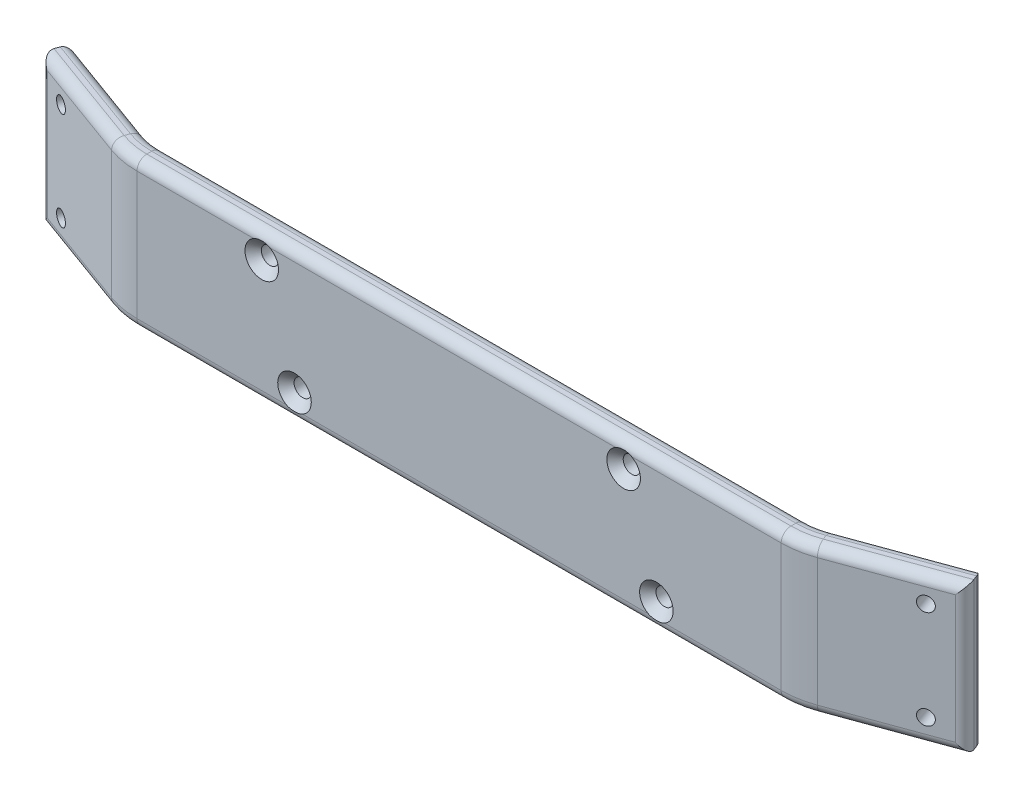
ISO-10303-21;
HEADER;
FILE_DESCRIPTION(('STEP AP214'),'2;1');
FILE_NAME('part.step','',(''),(''),'','','');
FILE_SCHEMA(('AUTOMOTIVE_DESIGN { 1 0 10303 214 1 1 1 1 }'));
ENDSEC;
DATA;
#1=APPLICATION_CONTEXT('core data for automotive mechanical design processes');
#2=APPLICATION_PROTOCOL_DEFINITION('international standard','automotive_design',2000,#1);
#3=PRODUCT_CONTEXT('',#1,'mechanical');
#4=PRODUCT('Part','Part','',(#3));
#5=PRODUCT_RELATED_PRODUCT_CATEGORY('part','',(#4));
#6=PRODUCT_DEFINITION_FORMATION('','',#4);
#7=PRODUCT_DEFINITION_CONTEXT('part definition',#1,'design');
#8=PRODUCT_DEFINITION('design','',#6,#7);
#9=PRODUCT_DEFINITION_SHAPE('','',#8);
#10=(LENGTH_UNIT() NAMED_UNIT(*) SI_UNIT(.MILLI.,.METRE.));
#11=(NAMED_UNIT(*) PLANE_ANGLE_UNIT() SI_UNIT($,.RADIAN.));
#12=(NAMED_UNIT(*) SI_UNIT($,.STERADIAN.) SOLID_ANGLE_UNIT());
#13=UNCERTAINTY_MEASURE_WITH_UNIT(LENGTH_MEASURE(1.E-05),#10,'distance_accuracy_value','');
#14=(GEOMETRIC_REPRESENTATION_CONTEXT(3) GLOBAL_UNCERTAINTY_ASSIGNED_CONTEXT((#13)) GLOBAL_UNIT_ASSIGNED_CONTEXT((#10,
#11,#12)) REPRESENTATION_CONTEXT('',''));
#15=CARTESIAN_POINT('',(0.,0.,0.));
#16=DIRECTION('',(0.,0.,1.));
#17=DIRECTION('',(1.,0.,0.));
#18=AXIS2_PLACEMENT_3D('',#15,#16,#17);
#19=CARTESIAN_POINT('',(-282.905856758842,45.,-12.8430629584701));
#20=DIRECTION('',(0.939692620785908,0.,0.342020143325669));
#21=DIRECTION('',(0.342020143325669,0.,-0.939692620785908));
#22=AXIS2_PLACEMENT_3D('',#19,#20,#21);
#23=PLANE('',#22);
#24=DIRECTION('',(0.342020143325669,0.,-0.939692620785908));
#25=VECTOR('',#24,1.);
#26=CARTESIAN_POINT('',(-282.905856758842,45.,-12.8430629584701));
#27=LINE('',#26,#25);
#28=CARTESIAN_POINT('',(-280.853735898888,45.,-18.4812186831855));
#29=VERTEX_POINT('',#28);
#30=CARTESIAN_POINT('',(-279.827675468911,45.,-21.3002965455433));
#31=VERTEX_POINT('',#30);
#32=EDGE_CURVE('E619',#29,#31,#27,.T.);
#33=ORIENTED_EDGE('',*,*,#32,.T.);
#34=DIRECTION('',(0.,-1.,0.));
#35=VECTOR('',#34,1.);
#36=CARTESIAN_POINT('',(-279.827675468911,45.,-21.3002965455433));
#37=LINE('',#36,#35);
#38=CARTESIAN_POINT('',(-279.827675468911,-45.0000000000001,-21.3002965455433));
#39=VERTEX_POINT('',#38);
#40=EDGE_CURVE('E342',#31,#39,#37,.T.);
#41=ORIENTED_EDGE('',*,*,#40,.T.);
#42=DIRECTION('',(0.342020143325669,0.,-0.939692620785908));
#43=VECTOR('',#42,1.);
#44=CARTESIAN_POINT('',(-282.905856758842,-45.0000000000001,-12.8430629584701));
#45=LINE('',#44,#43);
#46=CARTESIAN_POINT('',(-280.853735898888,-45.0000000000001,-18.4812186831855));
#47=VERTEX_POINT('',#46);
#48=EDGE_CURVE('E602',#47,#39,#45,.T.);
#49=ORIENTED_EDGE('',*,*,#48,.F.);
#50=DIRECTION('',(0.,-1.,0.));
#51=VECTOR('',#50,1.);
#52=CARTESIAN_POINT('',(-280.853735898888,45.,-18.4812186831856));
#53=LINE('',#52,#51);
#54=EDGE_CURVE('E340',#47,#29,#53,.F.);
#55=ORIENTED_EDGE('',*,*,#54,.T.);
#56=EDGE_LOOP('',(#33,#41,#49,#55));
#57=FACE_BOUND('',#56,.T.);
#58=ADVANCED_FACE('F30',(#57),#23,.F.);
#59=CARTESIAN_POINT('',(-264.112004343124,29.9999999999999,-6.00266009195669));
#60=DIRECTION('',(0.342020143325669,0.,-0.939692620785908));
#61=DIRECTION('',(-0.939692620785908,0.,-0.342020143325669));
#62=AXIS2_PLACEMENT_3D('',#59,#60,#61);
#63=CYLINDRICAL_SURFACE('',#62,4.4999999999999);
#64=CARTESIAN_POINT('',(-264.112004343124,29.9999999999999,-6.00266009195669));
#65=DIRECTION('',(-0.342020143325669,0.,0.939692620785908));
#66=DIRECTION('',(0.939692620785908,0.,0.342020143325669));
#67=AXIS2_PLACEMENT_3D('',#64,#65,#66);
#68=CIRCLE('',#67,4.4999999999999);
#69=CARTESIAN_POINT('',(-259.883387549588,29.9999999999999,-4.46356944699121));
#70=VERTEX_POINT('',#69);
#71=EDGE_CURVE('E616',#70,#70,#68,.T.);
#72=ORIENTED_EDGE('',*,*,#71,.T.);
#73=EDGE_LOOP('',(#72));
#74=FACE_BOUND('',#73,.T.);
#75=CARTESIAN_POINT('',(-258.981702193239,29.9999999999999,-20.0980494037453));
#76=DIRECTION('',(-0.342020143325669,0.,0.939692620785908));
#77=DIRECTION('',(0.939692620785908,0.,0.342020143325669));
#78=AXIS2_PLACEMENT_3D('',#75,#76,#77);
#79=CIRCLE('',#78,4.4999999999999);
#80=CARTESIAN_POINT('',(-254.753085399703,29.9999999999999,-18.5589587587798));
#81=VERTEX_POINT('',#80);
#82=EDGE_CURVE('E594',#81,#81,#79,.T.);
#83=ORIENTED_EDGE('',*,*,#82,.F.);
#84=EDGE_LOOP('',(#83));
#85=FACE_BOUND('',#84,.T.);
#86=ADVANCED_FACE('F563',(#74,#85),#63,.F.);
#87=CARTESIAN_POINT('',(-264.112004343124,-30.0000000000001,-6.00266009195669));
#88=DIRECTION('',(0.342020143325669,0.,-0.939692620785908));
#89=DIRECTION('',(-0.939692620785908,0.,-0.342020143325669));
#90=AXIS2_PLACEMENT_3D('',#87,#88,#89);
#91=CYLINDRICAL_SURFACE('',#90,4.4999999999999);
#92=CARTESIAN_POINT('',(-264.112004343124,-30.0000000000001,-6.00266009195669));
#93=DIRECTION('',(-0.342020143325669,0.,0.939692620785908));
#94=DIRECTION('',(0.939692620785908,0.,0.342020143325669));
#95=AXIS2_PLACEMENT_3D('',#92,#93,#94);
#96=CIRCLE('',#95,4.4999999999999);
#97=CARTESIAN_POINT('',(-259.883387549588,-30.0000000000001,-4.46356944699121));
#98=VERTEX_POINT('',#97);
#99=EDGE_CURVE('E613',#98,#98,#96,.T.);
#100=ORIENTED_EDGE('',*,*,#99,.T.);
#101=EDGE_LOOP('',(#100));
#102=FACE_BOUND('',#101,.T.);
#103=CARTESIAN_POINT('',(-258.981702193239,-30.0000000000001,-20.0980494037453));
#104=DIRECTION('',(-0.342020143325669,0.,0.939692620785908));
#105=DIRECTION('',(0.939692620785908,0.,0.342020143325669));
#106=AXIS2_PLACEMENT_3D('',#103,#104,#105);
#107=CIRCLE('',#106,4.4999999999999);
#108=CARTESIAN_POINT('',(-254.753085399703,-30.0000000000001,-18.5589587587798));
#109=VERTEX_POINT('',#108);
#110=EDGE_CURVE('E597',#109,#109,#107,.T.);
#111=ORIENTED_EDGE('',*,*,#110,.F.);
#112=EDGE_LOOP('',(#111));
#113=FACE_BOUND('',#112,.T.);
#114=ADVANCED_FACE('F567',(#102,#113),#91,.F.);
#115=CARTESIAN_POINT('',(-282.905856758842,45.,-12.8430629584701));
#116=DIRECTION('',(-0.342020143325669,0.,0.939692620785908));
#117=DIRECTION('',(0.939692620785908,0.,0.342020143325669));
#118=AXIS2_PLACEMENT_3D('',#115,#116,#117);
#119=PLANE('',#118);
#120=ORIENTED_EDGE('',*,*,#99,.F.);
#121=EDGE_LOOP('',(#120));
#122=FACE_BOUND('',#121,.T.);
#123=ORIENTED_EDGE('',*,*,#71,.F.);
#124=EDGE_LOOP('',(#123));
#125=FACE_BOUND('',#124,.T.);
#126=DIRECTION('',(0.,-1.,0.));
#127=VECTOR('',#126,1.);
#128=CARTESIAN_POINT('',(-277.267701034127,-45.0000000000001,-10.7909420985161));
#129=LINE('',#128,#127);
#130=CARTESIAN_POINT('',(-277.267701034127,39.,-10.7909420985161));
#131=VERTEX_POINT('',#130);
#132=CARTESIAN_POINT('',(-277.267701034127,-39.0000000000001,-10.7909420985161));
#133=VERTEX_POINT('',#132);
#134=EDGE_CURVE('E283',#131,#133,#129,.T.);
#135=ORIENTED_EDGE('',*,*,#134,.T.);
#136=DIRECTION('',(-0.939692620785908,0.,-0.342020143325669));
#137=VECTOR('',#136,1.);
#138=CARTESIAN_POINT('',(-282.905856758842,-39.0000000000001,-12.8430629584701));
#139=LINE('',#138,#137);
#140=CARTESIAN_POINT('',(-215.520793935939,-39.0000000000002,11.683094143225));
#141=VERTEX_POINT('',#140);
#142=EDGE_CURVE('E285',#133,#141,#139,.F.);
#143=ORIENTED_EDGE('',*,*,#142,.T.);
#144=DIRECTION('',(0.,1.,0.));
#145=VECTOR('',#144,1.);
#146=CARTESIAN_POINT('',(-215.520793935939,45.,11.683094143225));
#147=LINE('',#146,#145);
#148=CARTESIAN_POINT('',(-215.520793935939,39.,11.683094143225));
#149=VERTEX_POINT('',#148);
#150=EDGE_CURVE('E610',#141,#149,#147,.T.);
#151=ORIENTED_EDGE('',*,*,#150,.T.);
#152=DIRECTION('',(0.939692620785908,0.,0.342020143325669));
#153=VECTOR('',#152,1.);
#154=CARTESIAN_POINT('',(-282.905856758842,39.,-12.8430629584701));
#155=LINE('',#154,#153);
#156=EDGE_CURVE('E281',#149,#131,#155,.F.);
#157=ORIENTED_EDGE('',*,*,#156,.T.);
#158=EDGE_LOOP('',(#135,#143,#151,#157));
#159=FACE_BOUND('',#158,.T.);
#160=ADVANCED_FACE('F571',(#122,#125,#159),#119,.T.);
#161=CARTESIAN_POINT('',(-282.905856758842,45.,-12.8430629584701));
#162=DIRECTION('',(0.,1.,0.));
#163=DIRECTION('',(-0.342020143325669,0.,0.939692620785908));
#164=AXIS2_PLACEMENT_3D('',#161,#162,#163);
#165=PLANE('',#164);
#166=DIRECTION('',(0.342020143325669,0.,-0.939692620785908));
#167=VECTOR('',#166,1.);
#168=CARTESIAN_POINT('',(-215.520793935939,45.,11.683094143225));
#169=LINE('',#168,#167);
#170=CARTESIAN_POINT('',(-213.468673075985,45.,6.04493841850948));
#171=VERTEX_POINT('',#170);
#172=CARTESIAN_POINT('',(-212.442612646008,45.,3.22586055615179));
#173=VERTEX_POINT('',#172);
#174=EDGE_CURVE('E604',#171,#173,#169,.T.);
#175=ORIENTED_EDGE('',*,*,#174,.T.);
#176=DIRECTION('',(0.939692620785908,0.,0.342020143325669));
#177=VECTOR('',#176,1.);
#178=CARTESIAN_POINT('',(-279.827675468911,45.,-21.3002965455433));
#179=LINE('',#178,#177);
#180=EDGE_CURVE('E346',#173,#31,#179,.F.);
#181=ORIENTED_EDGE('',*,*,#180,.T.);
#182=ORIENTED_EDGE('',*,*,#32,.F.);
#183=DIRECTION('',(0.939692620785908,0.,0.342020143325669));
#184=VECTOR('',#183,1.);
#185=CARTESIAN_POINT('',(-280.853735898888,45.,-18.4812186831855));
#186=LINE('',#185,#184);
#187=EDGE_CURVE('E344',#29,#171,#186,.T.);
#188=ORIENTED_EDGE('',*,*,#187,.T.);
#189=EDGE_LOOP('',(#175,#181,#182,#188));
#190=FACE_BOUND('',#189,.T.);
#191=ADVANCED_FACE('F575',(#190),#165,.T.);
#192=CARTESIAN_POINT('',(-277.775554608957,45.,-26.9384522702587));
#193=DIRECTION('',(-0.342020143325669,0.,0.939692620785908));
#194=DIRECTION('',(0.939692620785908,0.,0.342020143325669));
#195=AXIS2_PLACEMENT_3D('',#192,#193,#194);
#196=PLANE('',#195);
#197=DIRECTION('',(0.,1.,0.));
#198=VECTOR('',#197,1.);
#199=CARTESIAN_POINT('',(-210.390491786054,45.,-2.41229516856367));
#200=LINE('',#199,#198);
#201=CARTESIAN_POINT('',(-210.390491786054,-39.0000000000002,-2.41229516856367));
#202=VERTEX_POINT('',#201);
#203=CARTESIAN_POINT('',(-210.390491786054,39.,-2.41229516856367));
#204=VERTEX_POINT('',#203);
#205=EDGE_CURVE('E589',#202,#204,#200,.T.);
#206=ORIENTED_EDGE('',*,*,#205,.F.);
#207=DIRECTION('',(-0.939692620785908,0.,-0.342020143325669));
#208=VECTOR('',#207,1.);
#209=CARTESIAN_POINT('',(-277.775554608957,-39.0000000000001,-26.9384522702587));
#210=LINE('',#209,#208);
#211=CARTESIAN_POINT('',(-272.137398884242,-39.0000000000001,-24.8863314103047));
#212=VERTEX_POINT('',#211);
#213=EDGE_CURVE('E268',#202,#212,#210,.T.);
#214=ORIENTED_EDGE('',*,*,#213,.T.);
#215=DIRECTION('',(0.,-1.,0.));
#216=VECTOR('',#215,1.);
#217=CARTESIAN_POINT('',(-272.137398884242,45.,-24.8863314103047));
#218=LINE('',#217,#216);
#219=CARTESIAN_POINT('',(-272.137398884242,39.,-24.8863314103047));
#220=VERTEX_POINT('',#219);
#221=EDGE_CURVE('E266',#212,#220,#218,.F.);
#222=ORIENTED_EDGE('',*,*,#221,.T.);
#223=DIRECTION('',(0.939692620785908,0.,0.342020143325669));
#224=VECTOR('',#223,1.);
#225=CARTESIAN_POINT('',(-210.390491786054,39.,-2.41229516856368));
#226=LINE('',#225,#224);
#227=EDGE_CURVE('E264',#220,#204,#226,.T.);
#228=ORIENTED_EDGE('',*,*,#227,.T.);
#229=EDGE_LOOP('',(#206,#214,#222,#228));
#230=FACE_BOUND('',#229,.T.);
#231=ORIENTED_EDGE('',*,*,#82,.T.);
#232=EDGE_LOOP('',(#231));
#233=FACE_BOUND('',#232,.T.);
#234=ORIENTED_EDGE('',*,*,#110,.T.);
#235=EDGE_LOOP('',(#234));
#236=FACE_BOUND('',#235,.T.);
#237=ADVANCED_FACE('F578',(#230,#233,#236),#196,.F.);
#238=CARTESIAN_POINT('',(252.718937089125,-45.,182.108418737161));
#239=DIRECTION('',(0.,-1.,0.));
#240=DIRECTION('',(0.939692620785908,0.,0.342020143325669));
#241=AXIS2_PLACEMENT_3D('',#238,#239,#240);
#242=PLANE('',#241);
#243=ORIENTED_EDGE('',*,*,#48,.T.);
#244=DIRECTION('',(-0.939692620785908,0.,-0.342020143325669));
#245=VECTOR('',#244,1.);
#246=CARTESIAN_POINT('',(-212.442612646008,-45.0000000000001,3.22586055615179));
#247=LINE('',#246,#245);
#248=CARTESIAN_POINT('',(-212.442612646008,-45.0000000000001,3.22586055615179));
#249=VERTEX_POINT('',#248);
#250=EDGE_CURVE('E272',#39,#249,#247,.F.);
#251=ORIENTED_EDGE('',*,*,#250,.T.);
#252=DIRECTION('',(-0.342020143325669,0.,0.939692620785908));
#253=VECTOR('',#252,1.);
#254=CARTESIAN_POINT('',(-215.520793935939,-45.0000000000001,11.683094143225));
#255=LINE('',#254,#253);
#256=CARTESIAN_POINT('',(-213.468673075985,-45.0000000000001,6.0449384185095));
#257=VERTEX_POINT('',#256);
#258=EDGE_CURVE('E599',#249,#257,#255,.T.);
#259=ORIENTED_EDGE('',*,*,#258,.T.);
#260=DIRECTION('',(-0.939692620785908,0.,-0.342020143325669));
#261=VECTOR('',#260,1.);
#262=CARTESIAN_POINT('',(254.771057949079,-45.,176.470263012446));
#263=LINE('',#262,#261);
#264=EDGE_CURVE('E270',#257,#47,#263,.T.);
#265=ORIENTED_EDGE('',*,*,#264,.T.);
#266=EDGE_LOOP('',(#243,#251,#259,#265));
#267=FACE_BOUND('',#266,.T.);
#268=ADVANCED_FACE('F32',(#267),#242,.T.);
#269=CARTESIAN_POINT('',(282.905856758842,-45.,-12.8430629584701));
#270=DIRECTION('',(-0.939692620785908,0.,0.342020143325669));
#271=DIRECTION('',(0.342020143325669,0.,0.939692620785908));
#272=AXIS2_PLACEMENT_3D('',#269,#270,#271);
#273=PLANE('',#272);
#274=DIRECTION('',(-0.342020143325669,0.,-0.939692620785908));
#275=VECTOR('',#274,1.);
#276=CARTESIAN_POINT('',(282.905856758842,45.,-12.8430629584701));
#277=LINE('',#276,#275);
#278=CARTESIAN_POINT('',(280.853735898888,45.,-18.4812186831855));
#279=VERTEX_POINT('',#278);
#280=CARTESIAN_POINT('',(279.827675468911,45.,-21.3002965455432));
#281=VERTEX_POINT('',#280);
#282=EDGE_CURVE('E622',#279,#281,#277,.T.);
#283=ORIENTED_EDGE('',*,*,#282,.F.);
#284=DIRECTION('',(0.,1.,0.));
#285=VECTOR('',#284,1.);
#286=CARTESIAN_POINT('',(280.853735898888,-45.,-18.4812186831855));
#287=LINE('',#286,#285);
#288=CARTESIAN_POINT('',(280.853735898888,-45.,-18.4812186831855));
#289=VERTEX_POINT('',#288);
#290=EDGE_CURVE('E338',#279,#289,#287,.F.);
#291=ORIENTED_EDGE('',*,*,#290,.T.);
#292=DIRECTION('',(-0.342020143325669,0.,-0.939692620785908));
#293=VECTOR('',#292,1.);
#294=CARTESIAN_POINT('',(282.905856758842,-45.,-12.8430629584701));
#295=LINE('',#294,#293);
#296=CARTESIAN_POINT('',(279.827675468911,-45.,-21.3002965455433));
#297=VERTEX_POINT('',#296);
#298=EDGE_CURVE('E238',#289,#297,#295,.T.);
#299=ORIENTED_EDGE('',*,*,#298,.T.);
#300=DIRECTION('',(0.,1.,0.));
#301=VECTOR('',#300,1.);
#302=CARTESIAN_POINT('',(279.827675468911,-45.,-21.3002965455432));
#303=LINE('',#302,#301);
#304=EDGE_CURVE('E336',#297,#281,#303,.T.);
#305=ORIENTED_EDGE('',*,*,#304,.T.);
#306=EDGE_LOOP('',(#283,#291,#299,#305));
#307=FACE_BOUND('',#306,.T.);
#308=ADVANCED_FACE('F520',(#307),#273,.F.);
#309=CARTESIAN_POINT('',(264.112004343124,30.,-6.00266009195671));
#310=DIRECTION('',(-0.342020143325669,0.,-0.939692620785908));
#311=DIRECTION('',(-0.939692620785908,0.,0.342020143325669));
#312=AXIS2_PLACEMENT_3D('',#309,#310,#311);
#313=CYLINDRICAL_SURFACE('',#312,4.50000000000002);
#314=CARTESIAN_POINT('',(264.112004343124,30.,-6.00266009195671));
#315=DIRECTION('',(0.342020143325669,0.,0.939692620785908));
#316=DIRECTION('',(0.939692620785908,0.,-0.342020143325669));
#317=AXIS2_PLACEMENT_3D('',#314,#315,#316);
#318=CIRCLE('',#317,4.50000000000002);
#319=CARTESIAN_POINT('',(268.340621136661,30.,-7.54175073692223));
#320=VERTEX_POINT('',#319);
#321=EDGE_CURVE('E629',#320,#320,#318,.T.);
#322=ORIENTED_EDGE('',*,*,#321,.T.);
#323=EDGE_LOOP('',(#322));
#324=FACE_BOUND('',#323,.T.);
#325=CARTESIAN_POINT('',(258.981702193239,30.,-20.0980494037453));
#326=DIRECTION('',(0.342020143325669,0.,0.939692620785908));
#327=DIRECTION('',(0.939692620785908,0.,-0.342020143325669));
#328=AXIS2_PLACEMENT_3D('',#325,#326,#327);
#329=CIRCLE('',#328,4.50000000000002);
#330=CARTESIAN_POINT('',(263.210318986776,30.,-21.6371400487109));
#331=VERTEX_POINT('',#330);
#332=EDGE_CURVE('E641',#331,#331,#329,.T.);
#333=ORIENTED_EDGE('',*,*,#332,.F.);
#334=EDGE_LOOP('',(#333));
#335=FACE_BOUND('',#334,.T.);
#336=ADVANCED_FACE('F523',(#324,#335),#313,.F.);
#337=CARTESIAN_POINT('',(264.112004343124,-30.,-6.00266009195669));
#338=DIRECTION('',(-0.342020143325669,0.,-0.939692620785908));
#339=DIRECTION('',(-0.939692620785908,0.,0.342020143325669));
#340=AXIS2_PLACEMENT_3D('',#337,#338,#339);
#341=CYLINDRICAL_SURFACE('',#340,4.50000000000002);
#342=CARTESIAN_POINT('',(264.112004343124,-30.,-6.00266009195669));
#343=DIRECTION('',(0.342020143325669,0.,0.939692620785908));
#344=DIRECTION('',(0.939692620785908,0.,-0.342020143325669));
#345=AXIS2_PLACEMENT_3D('',#342,#343,#344);
#346=CIRCLE('',#345,4.50000000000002);
#347=CARTESIAN_POINT('',(268.340621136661,-30.,-7.5417507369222));
#348=VERTEX_POINT('',#347);
#349=EDGE_CURVE('E632',#348,#348,#346,.T.);
#350=ORIENTED_EDGE('',*,*,#349,.T.);
#351=EDGE_LOOP('',(#350));
#352=FACE_BOUND('',#351,.T.);
#353=CARTESIAN_POINT('',(258.981702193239,-30.,-20.0980494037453));
#354=DIRECTION('',(0.342020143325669,0.,0.939692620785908));
#355=DIRECTION('',(0.939692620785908,0.,-0.342020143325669));
#356=AXIS2_PLACEMENT_3D('',#353,#354,#355);
#357=CIRCLE('',#356,4.50000000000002);
#358=CARTESIAN_POINT('',(263.210318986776,-30.,-21.6371400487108));
#359=VERTEX_POINT('',#358);
#360=EDGE_CURVE('E644',#359,#359,#357,.T.);
#361=ORIENTED_EDGE('',*,*,#360,.F.);
#362=EDGE_LOOP('',(#361));
#363=FACE_BOUND('',#362,.T.);
#364=ADVANCED_FACE('F527',(#352,#363),#341,.F.);
#365=CARTESIAN_POINT('',(-252.718937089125,45.,182.108418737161));
#366=DIRECTION('',(0.342020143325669,0.,0.939692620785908));
#367=DIRECTION('',(0.939692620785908,0.,-0.342020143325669));
#368=AXIS2_PLACEMENT_3D('',#365,#366,#367);
#369=PLANE('',#368);
#370=ORIENTED_EDGE('',*,*,#349,.F.);
#371=EDGE_LOOP('',(#370));
#372=FACE_BOUND('',#371,.T.);
#373=ORIENTED_EDGE('',*,*,#321,.F.);
#374=EDGE_LOOP('',(#373));
#375=FACE_BOUND('',#374,.T.);
#376=DIRECTION('',(0.,1.,0.));
#377=VECTOR('',#376,1.);
#378=CARTESIAN_POINT('',(277.267701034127,45.,-10.7909420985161));
#379=LINE('',#378,#377);
#380=CARTESIAN_POINT('',(277.267701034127,-39.,-10.7909420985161));
#381=VERTEX_POINT('',#380);
#382=CARTESIAN_POINT('',(277.267701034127,39.,-10.7909420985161));
#383=VERTEX_POINT('',#382);
#384=EDGE_CURVE('E276',#381,#383,#379,.T.);
#385=ORIENTED_EDGE('',*,*,#384,.T.);
#386=DIRECTION('',(0.939692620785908,0.,-0.342020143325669));
#387=VECTOR('',#386,1.);
#388=CARTESIAN_POINT('',(-252.718937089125,39.,182.108418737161));
#389=LINE('',#388,#387);
#390=CARTESIAN_POINT('',(215.520793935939,39.,11.683094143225));
#391=VERTEX_POINT('',#390);
#392=EDGE_CURVE('E278',#383,#391,#389,.F.);
#393=ORIENTED_EDGE('',*,*,#392,.T.);
#394=DIRECTION('',(0.,-1.,0.));
#395=VECTOR('',#394,1.);
#396=CARTESIAN_POINT('',(215.520793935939,45.,11.683094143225));
#397=LINE('',#396,#395);
#398=CARTESIAN_POINT('',(215.520793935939,-39.,11.683094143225));
#399=VERTEX_POINT('',#398);
#400=EDGE_CURVE('E635',#391,#399,#397,.T.);
#401=ORIENTED_EDGE('',*,*,#400,.T.);
#402=DIRECTION('',(-0.939692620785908,0.,0.342020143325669));
#403=VECTOR('',#402,1.);
#404=CARTESIAN_POINT('',(-252.718937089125,-39.0000000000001,182.108418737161));
#405=LINE('',#404,#403);
#406=EDGE_CURVE('E274',#399,#381,#405,.F.);
#407=ORIENTED_EDGE('',*,*,#406,.T.);
#408=EDGE_LOOP('',(#385,#393,#401,#407));
#409=FACE_BOUND('',#408,.T.);
#410=ADVANCED_FACE('F531',(#372,#375,#409),#369,.T.);
#411=CARTESIAN_POINT('',(282.905856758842,-45.,-12.8430629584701));
#412=DIRECTION('',(0.,-1.,0.));
#413=DIRECTION('',(0.939692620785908,0.,-0.342020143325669));
#414=AXIS2_PLACEMENT_3D('',#411,#412,#413);
#415=PLANE('',#414);
#416=DIRECTION('',(-0.342020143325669,0.,-0.939692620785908));
#417=VECTOR('',#416,1.);
#418=CARTESIAN_POINT('',(215.520793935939,-45.,11.683094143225));
#419=LINE('',#418,#417);
#420=CARTESIAN_POINT('',(213.468673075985,-45.,6.04493841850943));
#421=VERTEX_POINT('',#420);
#422=CARTESIAN_POINT('',(212.442612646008,-45.,3.22586055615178));
#423=VERTEX_POINT('',#422);
#424=EDGE_CURVE('E638',#421,#423,#419,.T.);
#425=ORIENTED_EDGE('',*,*,#424,.T.);
#426=DIRECTION('',(-0.939692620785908,0.,0.342020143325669));
#427=VECTOR('',#426,1.);
#428=CARTESIAN_POINT('',(279.827675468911,-45.,-21.3002965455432));
#429=LINE('',#428,#427);
#430=EDGE_CURVE('E350',#423,#297,#429,.F.);
#431=ORIENTED_EDGE('',*,*,#430,.T.);
#432=ORIENTED_EDGE('',*,*,#298,.F.);
#433=DIRECTION('',(-0.939692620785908,0.,0.342020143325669));
#434=VECTOR('',#433,1.);
#435=CARTESIAN_POINT('',(280.853735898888,-45.,-18.4812186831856));
#436=LINE('',#435,#434);
#437=EDGE_CURVE('E348',#289,#421,#436,.T.);
#438=ORIENTED_EDGE('',*,*,#437,.T.);
#439=EDGE_LOOP('',(#425,#431,#432,#438));
#440=FACE_BOUND('',#439,.T.);
#441=ADVANCED_FACE('F535',(#440),#415,.T.);
#442=CARTESIAN_POINT('',(-257.84923923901,45.,168.013029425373));
#443=DIRECTION('',(0.342020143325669,0.,0.939692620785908));
#444=DIRECTION('',(0.939692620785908,0.,-0.342020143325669));
#445=AXIS2_PLACEMENT_3D('',#442,#443,#444);
#446=PLANE('',#445);
#447=DIRECTION('',(0.,-1.,0.));
#448=VECTOR('',#447,1.);
#449=CARTESIAN_POINT('',(210.390491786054,45.,-2.41229516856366));
#450=LINE('',#449,#448);
#451=CARTESIAN_POINT('',(210.390491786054,39.,-2.41229516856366));
#452=VERTEX_POINT('',#451);
#453=CARTESIAN_POINT('',(210.390491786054,-39.,-2.41229516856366));
#454=VERTEX_POINT('',#453);
#455=EDGE_CURVE('E219',#452,#454,#450,.T.);
#456=ORIENTED_EDGE('',*,*,#455,.F.);
#457=DIRECTION('',(0.939692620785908,0.,-0.342020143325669));
#458=VECTOR('',#457,1.);
#459=CARTESIAN_POINT('',(277.775554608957,39.,-26.9384522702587));
#460=LINE('',#459,#458);
#461=CARTESIAN_POINT('',(272.137398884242,39.,-24.8863314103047));
#462=VERTEX_POINT('',#461);
#463=EDGE_CURVE('E235',#452,#462,#460,.T.);
#464=ORIENTED_EDGE('',*,*,#463,.T.);
#465=DIRECTION('',(0.,1.,0.));
#466=VECTOR('',#465,1.);
#467=CARTESIAN_POINT('',(272.137398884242,45.,-24.8863314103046));
#468=LINE('',#467,#466);
#469=CARTESIAN_POINT('',(272.137398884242,-39.,-24.8863314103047));
#470=VERTEX_POINT('',#469);
#471=EDGE_CURVE('E255',#462,#470,#468,.F.);
#472=ORIENTED_EDGE('',*,*,#471,.T.);
#473=DIRECTION('',(-0.939692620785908,0.,0.342020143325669));
#474=VECTOR('',#473,1.);
#475=CARTESIAN_POINT('',(210.390491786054,-39.,-2.41229516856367));
#476=LINE('',#475,#474);
#477=EDGE_CURVE('E237',#470,#454,#476,.T.);
#478=ORIENTED_EDGE('',*,*,#477,.T.);
#479=EDGE_LOOP('',(#456,#464,#472,#478));
#480=FACE_BOUND('',#479,.T.);
#481=ORIENTED_EDGE('',*,*,#332,.T.);
#482=EDGE_LOOP('',(#481));
#483=FACE_BOUND('',#482,.T.);
#484=ORIENTED_EDGE('',*,*,#360,.T.);
#485=EDGE_LOOP('',(#484));
#486=FACE_BOUND('',#485,.T.);
#487=ADVANCED_FACE('F232',(#480,#483,#486),#446,.F.);
#488=CARTESIAN_POINT('',(-252.718937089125,45.,182.108418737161));
#489=DIRECTION('',(0.,1.,0.));
#490=DIRECTION('',(0.342020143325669,0.,0.939692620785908));
#491=AXIS2_PLACEMENT_3D('',#488,#489,#490);
#492=PLANE('',#491);
#493=ORIENTED_EDGE('',*,*,#282,.T.);
#494=DIRECTION('',(0.939692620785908,0.,-0.342020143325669));
#495=VECTOR('',#494,1.);
#496=CARTESIAN_POINT('',(212.442612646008,45.,3.22586055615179));
#497=LINE('',#496,#495);
#498=CARTESIAN_POINT('',(212.442612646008,45.,3.22586055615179));
#499=VERTEX_POINT('',#498);
#500=EDGE_CURVE('E258',#281,#499,#497,.F.);
#501=ORIENTED_EDGE('',*,*,#500,.T.);
#502=DIRECTION('',(0.342020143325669,0.,0.939692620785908));
#503=VECTOR('',#502,1.);
#504=CARTESIAN_POINT('',(215.520793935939,45.,11.683094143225));
#505=LINE('',#504,#503);
#506=CARTESIAN_POINT('',(213.468673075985,45.,6.04493841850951));
#507=VERTEX_POINT('',#506);
#508=EDGE_CURVE('E647',#499,#507,#505,.T.);
#509=ORIENTED_EDGE('',*,*,#508,.T.);
#510=DIRECTION('',(0.939692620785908,0.,-0.342020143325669));
#511=VECTOR('',#510,1.);
#512=CARTESIAN_POINT('',(-254.771057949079,45.,176.470263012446));
#513=LINE('',#512,#511);
#514=EDGE_CURVE('E254',#507,#279,#513,.T.);
#515=ORIENTED_EDGE('',*,*,#514,.T.);
#516=EDGE_LOOP('',(#493,#501,#509,#515));
#517=FACE_BOUND('',#516,.T.);
#518=ADVANCED_FACE('F542',(#517),#492,.T.);
#519=CARTESIAN_POINT('',(-285.,45.,0.));
#520=DIRECTION('',(0.,0.,1.));
#521=DIRECTION('',(1.,0.,0.));
#522=AXIS2_PLACEMENT_3D('',#519,#520,#521);
#523=PLANE('',#522);
#524=CARTESIAN_POINT('',(100.5,29.9999999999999,0.));
#525=DIRECTION('',(0.,0.,1.));
#526=DIRECTION('',(1.,0.,0.));
#527=AXIS2_PLACEMENT_3D('',#524,#525,#526);
#528=CIRCLE('',#527,5.25000000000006);
#529=CARTESIAN_POINT('',(105.75,29.9999999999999,0.));
#530=VERTEX_POINT('',#529);
#531=EDGE_CURVE('E679',#530,#530,#528,.T.);
#532=ORIENTED_EDGE('',*,*,#531,.T.);
#533=EDGE_LOOP('',(#532));
#534=FACE_BOUND('',#533,.T.);
#535=CARTESIAN_POINT('',(-100.500000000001,-29.9999999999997,0.));
#536=DIRECTION('',(0.,0.,1.));
#537=DIRECTION('',(1.,0.,0.));
#538=AXIS2_PLACEMENT_3D('',#535,#536,#537);
#539=CIRCLE('',#538,5.25000000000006);
#540=CARTESIAN_POINT('',(-95.2500000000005,-29.9999999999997,0.));
#541=VERTEX_POINT('',#540);
#542=EDGE_CURVE('E673',#541,#541,#539,.T.);
#543=ORIENTED_EDGE('',*,*,#542,.T.);
#544=EDGE_LOOP('',(#543));
#545=FACE_BOUND('',#544,.T.);
#546=CARTESIAN_POINT('',(120.5,-29.9999999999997,0.));
#547=DIRECTION('',(0.,0.,1.));
#548=DIRECTION('',(1.,0.,0.));
#549=AXIS2_PLACEMENT_3D('',#546,#547,#548);
#550=CIRCLE('',#549,5.25000000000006);
#551=CARTESIAN_POINT('',(125.75,-29.9999999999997,0.));
#552=VERTEX_POINT('',#551);
#553=EDGE_CURVE('E676',#552,#552,#550,.T.);
#554=ORIENTED_EDGE('',*,*,#553,.T.);
#555=EDGE_LOOP('',(#554));
#556=FACE_BOUND('',#555,.T.);
#557=CARTESIAN_POINT('',(-120.500000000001,29.9999999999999,0.));
#558=DIRECTION('',(0.,0.,1.));
#559=DIRECTION('',(1.,0.,0.));
#560=AXIS2_PLACEMENT_3D('',#557,#558,#559);
#561=CIRCLE('',#560,5.25000000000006);
#562=CARTESIAN_POINT('',(-115.25,29.9999999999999,0.));
#563=VERTEX_POINT('',#562);
#564=EDGE_CURVE('E682',#563,#563,#561,.T.);
#565=ORIENTED_EDGE('',*,*,#564,.T.);
#566=EDGE_LOOP('',(#565));
#567=FACE_BOUND('',#566,.T.);
#568=DIRECTION('',(0.,1.,0.));
#569=VECTOR('',#568,1.);
#570=CARTESIAN_POINT('',(-196.709686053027,45.,0.));
#571=LINE('',#570,#569);
#572=CARTESIAN_POINT('',(-196.709686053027,-39.0000000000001,0.));
#573=VERTEX_POINT('',#572);
#574=CARTESIAN_POINT('',(-196.709686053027,39.,0.));
#575=VERTEX_POINT('',#574);
#576=EDGE_CURVE('E660',#573,#575,#571,.T.);
#577=ORIENTED_EDGE('',*,*,#576,.T.);
#578=DIRECTION('',(1.,0.,0.));
#579=VECTOR('',#578,1.);
#580=CARTESIAN_POINT('',(196.709686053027,39.,0.));
#581=LINE('',#580,#579);
#582=CARTESIAN_POINT('',(196.709686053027,39.,0.));
#583=VERTEX_POINT('',#582);
#584=EDGE_CURVE('E308',#575,#583,#581,.T.);
#585=ORIENTED_EDGE('',*,*,#584,.T.);
#586=DIRECTION('',(0.,-1.,0.));
#587=VECTOR('',#586,1.);
#588=CARTESIAN_POINT('',(196.709686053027,45.,0.));
#589=LINE('',#588,#587);
#590=CARTESIAN_POINT('',(196.709686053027,-39.,0.));
#591=VERTEX_POINT('',#590);
#592=EDGE_CURVE('E222',#583,#591,#589,.T.);
#593=ORIENTED_EDGE('',*,*,#592,.T.);
#594=DIRECTION('',(-1.,0.,0.));
#595=VECTOR('',#594,1.);
#596=CARTESIAN_POINT('',(-196.709686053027,-39.0000000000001,0.));
#597=LINE('',#596,#595);
#598=EDGE_CURVE('E306',#591,#573,#597,.T.);
#599=ORIENTED_EDGE('',*,*,#598,.T.);
#600=EDGE_LOOP('',(#577,#585,#593,#599));
#601=FACE_BOUND('',#600,.T.);
#602=ADVANCED_FACE('F545',(#534,#545,#556,#567,#601),#523,.F.);
#603=CARTESIAN_POINT('',(-285.,45.,15.));
#604=DIRECTION('',(0.,0.,1.));
#605=DIRECTION('',(1.,0.,0.));
#606=AXIS2_PLACEMENT_3D('',#603,#604,#605);
#607=PLANE('',#606);
#608=DIRECTION('',(1.,0.,0.));
#609=VECTOR('',#608,1.);
#610=CARTESIAN_POINT('',(-285.,39.,15.));
#611=LINE('',#610,#609);
#612=CARTESIAN_POINT('',(95.5946457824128,39.,15.));
#613=VERTEX_POINT('',#612);
#614=CARTESIAN_POINT('',(-115.594645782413,39.,15.));
#615=VERTEX_POINT('',#614);
#616=EDGE_CURVE('E328',#613,#615,#611,.F.);
#617=ORIENTED_EDGE('',*,*,#616,.T.);
#618=CARTESIAN_POINT('',(-120.500000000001,29.9999999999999,15.));
#619=DIRECTION('',(0.,0.,1.));
#620=DIRECTION('',(1.,0.,0.));
#621=AXIS2_PLACEMENT_3D('',#618,#619,#620);
#622=CIRCLE('',#621,10.2500000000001);
#623=CARTESIAN_POINT('',(-125.405354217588,39.,15.));
#624=VERTEX_POINT('',#623);
#625=EDGE_CURVE('E363',#615,#624,#622,.F.);
#626=ORIENTED_EDGE('',*,*,#625,.T.);
#627=CARTESIAN_POINT('',(-196.709686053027,39.,15.));
#628=VERTEX_POINT('',#627);
#629=EDGE_CURVE('E322',#624,#628,#611,.F.);
#630=ORIENTED_EDGE('',*,*,#629,.T.);
#631=DIRECTION('',(0.,1.,0.));
#632=VECTOR('',#631,1.);
#633=CARTESIAN_POINT('',(-196.709686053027,45.,15.));
#634=LINE('',#633,#632);
#635=CARTESIAN_POINT('',(-196.709686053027,-39.0000000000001,15.));
#636=VERTEX_POINT('',#635);
#637=EDGE_CURVE('E657',#636,#628,#634,.T.);
#638=ORIENTED_EDGE('',*,*,#637,.F.);
#639=DIRECTION('',(-1.,0.,0.));
#640=VECTOR('',#639,1.);
#641=CARTESIAN_POINT('',(-285.,-39.0000000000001,15.));
#642=LINE('',#641,#640);
#643=CARTESIAN_POINT('',(-105.405354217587,-39.0000000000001,15.));
#644=VERTEX_POINT('',#643);
#645=EDGE_CURVE('E319',#636,#644,#642,.F.);
#646=ORIENTED_EDGE('',*,*,#645,.T.);
#647=CARTESIAN_POINT('',(-100.500000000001,-29.9999999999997,15.));
#648=DIRECTION('',(0.,0.,1.));
#649=DIRECTION('',(1.,0.,0.));
#650=AXIS2_PLACEMENT_3D('',#647,#648,#649);
#651=CIRCLE('',#650,10.2500000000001);
#652=CARTESIAN_POINT('',(-95.594645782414,-39.0000000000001,15.));
#653=VERTEX_POINT('',#652);
#654=EDGE_CURVE('E358',#644,#653,#651,.F.);
#655=ORIENTED_EDGE('',*,*,#654,.T.);
#656=CARTESIAN_POINT('',(115.594645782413,-39.,15.));
#657=VERTEX_POINT('',#656);
#658=EDGE_CURVE('E323',#653,#657,#642,.F.);
#659=ORIENTED_EDGE('',*,*,#658,.T.);
#660=CARTESIAN_POINT('',(120.5,-29.9999999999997,15.));
#661=DIRECTION('',(0.,0.,1.));
#662=DIRECTION('',(1.,0.,0.));
#663=AXIS2_PLACEMENT_3D('',#660,#661,#662);
#664=CIRCLE('',#663,10.2500000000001);
#665=CARTESIAN_POINT('',(125.405354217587,-39.,15.));
#666=VERTEX_POINT('',#665);
#667=EDGE_CURVE('E361',#657,#666,#664,.F.);
#668=ORIENTED_EDGE('',*,*,#667,.T.);
#669=CARTESIAN_POINT('',(196.709686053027,-39.,15.));
#670=VERTEX_POINT('',#669);
#671=EDGE_CURVE('E318',#666,#670,#642,.F.);
#672=ORIENTED_EDGE('',*,*,#671,.T.);
#673=DIRECTION('',(0.,-1.,0.));
#674=VECTOR('',#673,1.);
#675=CARTESIAN_POINT('',(196.709686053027,45.,15.));
#676=LINE('',#675,#674);
#677=CARTESIAN_POINT('',(196.709686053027,39.,15.));
#678=VERTEX_POINT('',#677);
#679=EDGE_CURVE('E669',#678,#670,#676,.T.);
#680=ORIENTED_EDGE('',*,*,#679,.F.);
#681=CARTESIAN_POINT('',(105.405354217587,39.,15.));
#682=VERTEX_POINT('',#681);
#683=EDGE_CURVE('E324',#678,#682,#611,.F.);
#684=ORIENTED_EDGE('',*,*,#683,.T.);
#685=CARTESIAN_POINT('',(100.5,29.9999999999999,15.));
#686=DIRECTION('',(0.,0.,1.));
#687=DIRECTION('',(1.,0.,0.));
#688=AXIS2_PLACEMENT_3D('',#685,#686,#687);
#689=CIRCLE('',#688,10.2500000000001);
#690=EDGE_CURVE('E355',#682,#613,#689,.F.);
#691=ORIENTED_EDGE('',*,*,#690,.T.);
#692=EDGE_LOOP('',(#617,#626,#630,#638,#646,#655,#659,#668,#672,#680,#684,#691));
#693=FACE_BOUND('',#692,.T.);
#694=ADVANCED_FACE('F547',(#693),#607,.T.);
#695=CARTESIAN_POINT('',(285.,-45.,15.));
#696=DIRECTION('',(0.,-1.,0.));
#697=DIRECTION('',(1.,0.,0.));
#698=AXIS2_PLACEMENT_3D('',#695,#696,#697);
#699=PLANE('',#698);
#700=DIRECTION('',(0.,0.,1.));
#701=VECTOR('',#700,1.);
#702=CARTESIAN_POINT('',(-196.709686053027,-45.0000000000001,15.));
#703=LINE('',#702,#701);
#704=CARTESIAN_POINT('',(-196.709686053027,-45.0000000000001,6.));
#705=VERTEX_POINT('',#704);
#706=CARTESIAN_POINT('',(-196.709686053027,-45.0000000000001,9.));
#707=VERTEX_POINT('',#706);
#708=EDGE_CURVE('E654',#705,#707,#703,.T.);
#709=ORIENTED_EDGE('',*,*,#708,.F.);
#710=DIRECTION('',(-1.,0.,0.));
#711=VECTOR('',#710,1.);
#712=CARTESIAN_POINT('',(196.709686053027,-45.,6.));
#713=LINE('',#712,#711);
#714=CARTESIAN_POINT('',(196.709686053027,-45.,6.));
#715=VERTEX_POINT('',#714);
#716=EDGE_CURVE('E316',#705,#715,#713,.F.);
#717=ORIENTED_EDGE('',*,*,#716,.T.);
#718=DIRECTION('',(0.,0.,-1.));
#719=VECTOR('',#718,1.);
#720=CARTESIAN_POINT('',(196.709686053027,-45.,15.));
#721=LINE('',#720,#719);
#722=CARTESIAN_POINT('',(196.709686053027,-45.,9.));
#723=VERTEX_POINT('',#722);
#724=EDGE_CURVE('E666',#723,#715,#721,.T.);
#725=ORIENTED_EDGE('',*,*,#724,.F.);
#726=DIRECTION('',(-1.,0.,0.));
#727=VECTOR('',#726,1.);
#728=CARTESIAN_POINT('',(285.,-45.,9.));
#729=LINE('',#728,#727);
#730=EDGE_CURVE('E314',#723,#707,#729,.T.);
#731=ORIENTED_EDGE('',*,*,#730,.T.);
#732=EDGE_LOOP('',(#709,#717,#725,#731));
#733=FACE_BOUND('',#732,.T.);
#734=ADVANCED_FACE('F550',(#733),#699,.T.);
#735=CARTESIAN_POINT('',(-285.,45.,15.));
#736=DIRECTION('',(0.,1.,0.));
#737=DIRECTION('',(0.,0.,1.));
#738=AXIS2_PLACEMENT_3D('',#735,#736,#737);
#739=PLANE('',#738);
#740=DIRECTION('',(0.,0.,1.));
#741=VECTOR('',#740,1.);
#742=CARTESIAN_POINT('',(196.709686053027,45.,15.));
#743=LINE('',#742,#741);
#744=CARTESIAN_POINT('',(196.709686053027,45.,6.));
#745=VERTEX_POINT('',#744);
#746=CARTESIAN_POINT('',(196.709686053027,45.,9.));
#747=VERTEX_POINT('',#746);
#748=EDGE_CURVE('E663',#745,#747,#743,.T.);
#749=ORIENTED_EDGE('',*,*,#748,.F.);
#750=DIRECTION('',(1.,0.,0.));
#751=VECTOR('',#750,1.);
#752=CARTESIAN_POINT('',(-196.709686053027,45.,6.));
#753=LINE('',#752,#751);
#754=CARTESIAN_POINT('',(-196.709686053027,45.,6.));
#755=VERTEX_POINT('',#754);
#756=EDGE_CURVE('E312',#745,#755,#753,.F.);
#757=ORIENTED_EDGE('',*,*,#756,.T.);
#758=DIRECTION('',(0.,0.,-1.));
#759=VECTOR('',#758,1.);
#760=CARTESIAN_POINT('',(-196.709686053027,45.,15.));
#761=LINE('',#760,#759);
#762=CARTESIAN_POINT('',(-196.709686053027,45.,9.));
#763=VERTEX_POINT('',#762);
#764=EDGE_CURVE('E239',#763,#755,#761,.T.);
#765=ORIENTED_EDGE('',*,*,#764,.F.);
#766=DIRECTION('',(1.,0.,0.));
#767=VECTOR('',#766,1.);
#768=CARTESIAN_POINT('',(-285.,45.,9.));
#769=LINE('',#768,#767);
#770=EDGE_CURVE('E310',#763,#747,#769,.T.);
#771=ORIENTED_EDGE('',*,*,#770,.T.);
#772=EDGE_LOOP('',(#749,#757,#765,#771));
#773=FACE_BOUND('',#772,.T.);
#774=ADVANCED_FACE('F518',(#773),#739,.T.);
#775=CARTESIAN_POINT('',(-100.500000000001,-29.9999999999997,15.));
#776=DIRECTION('',(0.,0.,-1.));
#777=DIRECTION('',(-1.,0.,0.));
#778=AXIS2_PLACEMENT_3D('',#775,#776,#777);
#779=CYLINDRICAL_SURFACE('',#778,5.25000000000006);
#780=CARTESIAN_POINT('',(-100.500000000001,-29.9999999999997,10.));
#781=DIRECTION('',(0.,0.,1.));
#782=DIRECTION('',(1.,0.,0.));
#783=AXIS2_PLACEMENT_3D('',#780,#781,#782);
#784=CIRCLE('',#783,5.25000000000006);
#785=CARTESIAN_POINT('',(-95.2500000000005,-29.9999999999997,10.));
#786=VERTEX_POINT('',#785);
#787=EDGE_CURVE('E38',#786,#786,#784,.T.);
#788=ORIENTED_EDGE('',*,*,#787,.T.);
#789=EDGE_LOOP('',(#788));
#790=FACE_BOUND('',#789,.T.);
#791=ORIENTED_EDGE('',*,*,#542,.F.);
#792=EDGE_LOOP('',(#791));
#793=FACE_BOUND('',#792,.T.);
#794=ADVANCED_FACE('F514',(#790,#793),#779,.F.);
#795=CARTESIAN_POINT('',(120.5,-29.9999999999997,15.));
#796=DIRECTION('',(0.,0.,-1.));
#797=DIRECTION('',(-1.,0.,0.));
#798=AXIS2_PLACEMENT_3D('',#795,#796,#797);
#799=CYLINDRICAL_SURFACE('',#798,5.25000000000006);
#800=CARTESIAN_POINT('',(120.5,-29.9999999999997,10.));
#801=DIRECTION('',(0.,0.,1.));
#802=DIRECTION('',(1.,0.,0.));
#803=AXIS2_PLACEMENT_3D('',#800,#801,#802);
#804=CIRCLE('',#803,5.25000000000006);
#805=CARTESIAN_POINT('',(125.75,-29.9999999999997,10.));
#806=VERTEX_POINT('',#805);
#807=EDGE_CURVE('E402',#806,#806,#804,.T.);
#808=ORIENTED_EDGE('',*,*,#807,.T.);
#809=EDGE_LOOP('',(#808));
#810=FACE_BOUND('',#809,.T.);
#811=ORIENTED_EDGE('',*,*,#553,.F.);
#812=EDGE_LOOP('',(#811));
#813=FACE_BOUND('',#812,.T.);
#814=ADVANCED_FACE('F510',(#810,#813),#799,.F.);
#815=CARTESIAN_POINT('',(100.5,29.9999999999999,15.));
#816=DIRECTION('',(0.,0.,-1.));
#817=DIRECTION('',(-1.,0.,0.));
#818=AXIS2_PLACEMENT_3D('',#815,#816,#817);
#819=CYLINDRICAL_SURFACE('',#818,5.25000000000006);
#820=CARTESIAN_POINT('',(100.5,29.9999999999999,9.99999999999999));
#821=DIRECTION('',(0.,0.,1.));
#822=DIRECTION('',(1.,0.,0.));
#823=AXIS2_PLACEMENT_3D('',#820,#821,#822);
#824=CIRCLE('',#823,5.25000000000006);
#825=CARTESIAN_POINT('',(105.75,29.9999999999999,9.99999999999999));
#826=VERTEX_POINT('',#825);
#827=EDGE_CURVE('E11',#826,#826,#824,.T.);
#828=ORIENTED_EDGE('',*,*,#827,.T.);
#829=EDGE_LOOP('',(#828));
#830=FACE_BOUND('',#829,.T.);
#831=ORIENTED_EDGE('',*,*,#531,.F.);
#832=EDGE_LOOP('',(#831));
#833=FACE_BOUND('',#832,.T.);
#834=ADVANCED_FACE('F506',(#830,#833),#819,.F.);
#835=CARTESIAN_POINT('',(-120.500000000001,29.9999999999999,15.));
#836=DIRECTION('',(0.,0.,-1.));
#837=DIRECTION('',(-1.,0.,0.));
#838=AXIS2_PLACEMENT_3D('',#835,#836,#837);
#839=CYLINDRICAL_SURFACE('',#838,5.25000000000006);
#840=CARTESIAN_POINT('',(-120.500000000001,29.9999999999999,10.));
#841=DIRECTION('',(0.,0.,1.));
#842=DIRECTION('',(1.,0.,0.));
#843=AXIS2_PLACEMENT_3D('',#840,#841,#842);
#844=CIRCLE('',#843,5.25000000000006);
#845=CARTESIAN_POINT('',(-115.25,29.9999999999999,10.));
#846=VERTEX_POINT('',#845);
#847=EDGE_CURVE('E352',#846,#846,#844,.T.);
#848=ORIENTED_EDGE('',*,*,#847,.T.);
#849=EDGE_LOOP('',(#848));
#850=FACE_BOUND('',#849,.T.);
#851=ORIENTED_EDGE('',*,*,#564,.F.);
#852=EDGE_LOOP('',(#851));
#853=FACE_BOUND('',#852,.T.);
#854=ADVANCED_FACE('F502',(#850,#853),#839,.F.);
#855=CARTESIAN_POINT('',(196.709686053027,45.,-40.));
#856=DIRECTION('',(0.,-1.,0.));
#857=DIRECTION('',(0.,0.,-1.));
#858=AXIS2_PLACEMENT_3D('',#855,#856,#857);
#859=PLANE('',#858);
#860=ORIENTED_EDGE('',*,*,#508,.F.);
#861=CARTESIAN_POINT('',(196.709686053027,45.,-40.));
#862=DIRECTION('',(0.,-1.,0.));
#863=DIRECTION('',(0.,0.,-1.));
#864=AXIS2_PLACEMENT_3D('',#861,#862,#863);
#865=CIRCLE('',#864,46.);
#866=EDGE_CURVE('E244',#499,#745,#865,.T.);
#867=ORIENTED_EDGE('',*,*,#866,.T.);
#868=ORIENTED_EDGE('',*,*,#748,.T.);
#869=CARTESIAN_POINT('',(196.709686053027,45.,-40.));
#870=DIRECTION('',(0.,-1.,0.));
#871=DIRECTION('',(0.,0.,-1.));
#872=AXIS2_PLACEMENT_3D('',#869,#870,#871);
#873=CIRCLE('',#872,49.);
#874=EDGE_CURVE('E227',#747,#507,#873,.F.);
#875=ORIENTED_EDGE('',*,*,#874,.T.);
#876=EDGE_LOOP('',(#860,#867,#868,#875));
#877=FACE_BOUND('',#876,.T.);
#878=ADVANCED_FACE('F498',(#877),#859,.F.);
#879=CARTESIAN_POINT('',(196.709686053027,-45.,-40.));
#880=DIRECTION('',(0.,1.,0.));
#881=DIRECTION('',(-1.,0.,0.));
#882=AXIS2_PLACEMENT_3D('',#879,#880,#881);
#883=PLANE('',#882);
#884=ORIENTED_EDGE('',*,*,#724,.T.);
#885=CARTESIAN_POINT('',(196.709686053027,-45.,-40.));
#886=DIRECTION('',(0.,1.,0.));
#887=DIRECTION('',(-1.,0.,0.));
#888=AXIS2_PLACEMENT_3D('',#885,#886,#887);
#889=CIRCLE('',#888,46.);
#890=EDGE_CURVE('E334',#715,#423,#889,.T.);
#891=ORIENTED_EDGE('',*,*,#890,.T.);
#892=ORIENTED_EDGE('',*,*,#424,.F.);
#893=CARTESIAN_POINT('',(196.709686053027,-45.,-40.));
#894=DIRECTION('',(0.,1.,0.));
#895=DIRECTION('',(-1.,0.,0.));
#896=AXIS2_PLACEMENT_3D('',#893,#894,#895);
#897=CIRCLE('',#896,49.);
#898=EDGE_CURVE('E332',#421,#723,#897,.F.);
#899=ORIENTED_EDGE('',*,*,#898,.T.);
#900=EDGE_LOOP('',(#884,#891,#892,#899));
#901=FACE_BOUND('',#900,.T.);
#902=ADVANCED_FACE('F494',(#901),#883,.F.);
#903=CARTESIAN_POINT('',(196.709686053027,622.256442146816,-40.));
#904=DIRECTION('',(0.,-1.,0.));
#905=DIRECTION('',(0.,0.,-1.));
#906=AXIS2_PLACEMENT_3D('',#903,#904,#905);
#907=CYLINDRICAL_SURFACE('',#906,55.);
#908=ORIENTED_EDGE('',*,*,#400,.F.);
#909=CARTESIAN_POINT('',(196.709686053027,39.,-40.));
#910=DIRECTION('',(0.,-1.,0.));
#911=DIRECTION('',(0.,0.,-1.));
#912=AXIS2_PLACEMENT_3D('',#909,#910,#911);
#913=CIRCLE('',#912,55.);
#914=EDGE_CURVE('E300',#391,#678,#913,.T.);
#915=ORIENTED_EDGE('',*,*,#914,.T.);
#916=ORIENTED_EDGE('',*,*,#679,.T.);
#917=CARTESIAN_POINT('',(196.709686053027,-39.,-40.));
#918=DIRECTION('',(0.,1.,0.));
#919=DIRECTION('',(-1.,0.,0.));
#920=AXIS2_PLACEMENT_3D('',#917,#918,#919);
#921=CIRCLE('',#920,55.);
#922=EDGE_CURVE('E298',#670,#399,#921,.T.);
#923=ORIENTED_EDGE('',*,*,#922,.T.);
#924=EDGE_LOOP('',(#908,#915,#916,#923));
#925=FACE_BOUND('',#924,.T.);
#926=ADVANCED_FACE('F491',(#925),#907,.T.);
#927=CARTESIAN_POINT('',(196.709686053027,622.256442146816,-40.));
#928=DIRECTION('',(0.,-1.,0.));
#929=DIRECTION('',(0.,0.,-1.));
#930=AXIS2_PLACEMENT_3D('',#927,#928,#929);
#931=CYLINDRICAL_SURFACE('',#930,40.);
#932=ORIENTED_EDGE('',*,*,#592,.F.);
#933=CARTESIAN_POINT('',(196.709686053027,39.,-40.));
#934=DIRECTION('',(0.,-1.,0.));
#935=DIRECTION('',(0.,0.,-1.));
#936=AXIS2_PLACEMENT_3D('',#933,#934,#935);
#937=CIRCLE('',#936,40.);
#938=EDGE_CURVE('E216',#583,#452,#937,.F.);
#939=ORIENTED_EDGE('',*,*,#938,.T.);
#940=ORIENTED_EDGE('',*,*,#455,.T.);
#941=CARTESIAN_POINT('',(196.709686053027,-39.,-40.));
#942=DIRECTION('',(0.,1.,0.));
#943=DIRECTION('',(-1.,0.,0.));
#944=AXIS2_PLACEMENT_3D('',#941,#942,#943);
#945=CIRCLE('',#944,40.);
#946=EDGE_CURVE('E228',#454,#591,#945,.F.);
#947=ORIENTED_EDGE('',*,*,#946,.T.);
#948=EDGE_LOOP('',(#932,#939,#940,#947));
#949=FACE_BOUND('',#948,.T.);
#950=ADVANCED_FACE('F218',(#949),#931,.F.);
#951=CARTESIAN_POINT('',(-196.709686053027,-45.0000000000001,-40.));
#952=DIRECTION('',(0.,1.,0.));
#953=DIRECTION('',(-1.,0.,0.));
#954=AXIS2_PLACEMENT_3D('',#951,#952,#953);
#955=PLANE('',#954);
#956=ORIENTED_EDGE('',*,*,#258,.F.);
#957=CARTESIAN_POINT('',(-196.709686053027,-45.0000000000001,-40.));
#958=DIRECTION('',(0.,1.,0.));
#959=DIRECTION('',(-1.,0.,0.));
#960=AXIS2_PLACEMENT_3D('',#957,#958,#959);
#961=CIRCLE('',#960,46.);
#962=EDGE_CURVE('E296',#249,#705,#961,.T.);
#963=ORIENTED_EDGE('',*,*,#962,.T.);
#964=ORIENTED_EDGE('',*,*,#708,.T.);
#965=CARTESIAN_POINT('',(-196.709686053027,-45.0000000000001,-40.));
#966=DIRECTION('',(0.,1.,0.));
#967=DIRECTION('',(-1.,0.,0.));
#968=AXIS2_PLACEMENT_3D('',#965,#966,#967);
#969=CIRCLE('',#968,49.);
#970=EDGE_CURVE('E294',#707,#257,#969,.F.);
#971=ORIENTED_EDGE('',*,*,#970,.T.);
#972=EDGE_LOOP('',(#956,#963,#964,#971));
#973=FACE_BOUND('',#972,.T.);
#974=ADVANCED_FACE('F484',(#973),#955,.F.);
#975=CARTESIAN_POINT('',(-196.709686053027,45.,-40.));
#976=DIRECTION('',(0.,-1.,0.));
#977=DIRECTION('',(0.,0.,-1.));
#978=AXIS2_PLACEMENT_3D('',#975,#976,#977);
#979=PLANE('',#978);
#980=ORIENTED_EDGE('',*,*,#764,.T.);
#981=CARTESIAN_POINT('',(-196.709686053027,45.,-40.));
#982=DIRECTION('',(0.,-1.,0.));
#983=DIRECTION('',(0.,0.,-1.));
#984=AXIS2_PLACEMENT_3D('',#981,#982,#983);
#985=CIRCLE('',#984,46.);
#986=EDGE_CURVE('E330',#755,#173,#985,.T.);
#987=ORIENTED_EDGE('',*,*,#986,.T.);
#988=ORIENTED_EDGE('',*,*,#174,.F.);
#989=CARTESIAN_POINT('',(-196.709686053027,45.,-40.));
#990=DIRECTION('',(0.,-1.,0.));
#991=DIRECTION('',(0.,0.,-1.));
#992=AXIS2_PLACEMENT_3D('',#989,#990,#991);
#993=CIRCLE('',#992,49.);
#994=EDGE_CURVE('E327',#171,#763,#993,.F.);
#995=ORIENTED_EDGE('',*,*,#994,.T.);
#996=EDGE_LOOP('',(#980,#987,#988,#995));
#997=FACE_BOUND('',#996,.T.);
#998=ADVANCED_FACE('F480',(#997),#979,.F.);
#999=CARTESIAN_POINT('',(-196.709686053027,-630.235760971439,-40.));
#1000=DIRECTION('',(0.,1.,0.));
#1001=DIRECTION('',(0.,0.,1.));
#1002=AXIS2_PLACEMENT_3D('',#999,#1000,#1001);
#1003=CYLINDRICAL_SURFACE('',#1002,55.);
#1004=ORIENTED_EDGE('',*,*,#150,.F.);
#1005=CARTESIAN_POINT('',(-196.709686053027,-39.0000000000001,-40.));
#1006=DIRECTION('',(0.,1.,0.));
#1007=DIRECTION('',(-1.,0.,0.));
#1008=AXIS2_PLACEMENT_3D('',#1005,#1006,#1007);
#1009=CIRCLE('',#1008,55.);
#1010=EDGE_CURVE('E304',#141,#636,#1009,.T.);
#1011=ORIENTED_EDGE('',*,*,#1010,.T.);
#1012=ORIENTED_EDGE('',*,*,#637,.T.);
#1013=CARTESIAN_POINT('',(-196.709686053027,39.,-40.));
#1014=DIRECTION('',(0.,-1.,0.));
#1015=DIRECTION('',(0.,0.,-1.));
#1016=AXIS2_PLACEMENT_3D('',#1013,#1014,#1015);
#1017=CIRCLE('',#1016,55.);
#1018=EDGE_CURVE('E302',#628,#149,#1017,.T.);
#1019=ORIENTED_EDGE('',*,*,#1018,.T.);
#1020=EDGE_LOOP('',(#1004,#1011,#1012,#1019));
#1021=FACE_BOUND('',#1020,.T.);
#1022=ADVANCED_FACE('F476',(#1021),#1003,.T.);
#1023=CARTESIAN_POINT('',(-196.709686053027,-630.235760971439,-40.));
#1024=DIRECTION('',(0.,1.,0.));
#1025=DIRECTION('',(0.,0.,1.));
#1026=AXIS2_PLACEMENT_3D('',#1023,#1024,#1025);
#1027=CYLINDRICAL_SURFACE('',#1026,40.);
#1028=ORIENTED_EDGE('',*,*,#576,.F.);
#1029=CARTESIAN_POINT('',(-196.709686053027,-39.0000000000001,-40.));
#1030=DIRECTION('',(0.,1.,0.));
#1031=DIRECTION('',(-1.,0.,0.));
#1032=AXIS2_PLACEMENT_3D('',#1029,#1030,#1031);
#1033=CIRCLE('',#1032,40.);
#1034=EDGE_CURVE('E292',#573,#202,#1033,.F.);
#1035=ORIENTED_EDGE('',*,*,#1034,.T.);
#1036=ORIENTED_EDGE('',*,*,#205,.T.);
#1037=CARTESIAN_POINT('',(-196.709686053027,39.,-40.));
#1038=DIRECTION('',(0.,-1.,0.));
#1039=DIRECTION('',(0.,0.,-1.));
#1040=AXIS2_PLACEMENT_3D('',#1037,#1038,#1039);
#1041=CIRCLE('',#1040,40.);
#1042=EDGE_CURVE('E290',#204,#575,#1041,.F.);
#1043=ORIENTED_EDGE('',*,*,#1042,.T.);
#1044=EDGE_LOOP('',(#1028,#1035,#1036,#1043));
#1045=FACE_BOUND('',#1044,.T.);
#1046=ADVANCED_FACE('F472',(#1045),#1027,.F.);
#1047=CARTESIAN_POINT('',(-279.827675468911,-39.0000000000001,-21.3002965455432));
#1048=DIRECTION('',(0.939692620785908,0.,0.342020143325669));
#1049=DIRECTION('',(0.342020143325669,0.,-0.939692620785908));
#1050=AXIS2_PLACEMENT_3D('',#1047,#1048,#1049);
#1051=CYLINDRICAL_SURFACE('',#1050,6.);
#1052=CARTESIAN_POINT('',(-212.442612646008,-39.0000000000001,3.22586055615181));
#1053=DIRECTION('',(0.93969262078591,0.,0.342020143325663));
#1054=DIRECTION('',(0.342020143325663,0.,-0.93969262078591));
#1055=AXIS2_PLACEMENT_3D('',#1052,#1053,#1054);
#1056=CIRCLE('',#1055,6.);
#1057=EDGE_CURVE('E688',#249,#202,#1056,.T.);
#1058=ORIENTED_EDGE('',*,*,#1057,.F.);
#1059=ORIENTED_EDGE('',*,*,#250,.F.);
#1060=CARTESIAN_POINT('',(-274.189519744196,-39.0000000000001,-19.2481756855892));
#1061=DIRECTION('',(0.664463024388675,-0.707106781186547,0.241844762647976));
#1062=DIRECTION('',(-0.664463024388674,-0.707106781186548,-0.241844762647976));
#1063=AXIS2_PLACEMENT_3D('',#1060,#1061,#1062);
#1064=ELLIPSE('',#1063,8.48528137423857,6.);
#1065=EDGE_CURVE('E685',#212,#39,#1064,.F.);
#1066=ORIENTED_EDGE('',*,*,#1065,.F.);
#1067=ORIENTED_EDGE('',*,*,#213,.F.);
#1068=EDGE_LOOP('',(#1058,#1059,#1066,#1067));
#1069=FACE_BOUND('',#1068,.T.);
#1070=ADVANCED_FACE('F468',(#1069),#1051,.T.);
#1071=CARTESIAN_POINT('',(-274.189519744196,45.,-19.2481756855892));
#1072=DIRECTION('',(0.,-1.,0.));
#1073=DIRECTION('',(0.,0.,-1.));
#1074=AXIS2_PLACEMENT_3D('',#1071,#1072,#1073);
#1075=CYLINDRICAL_SURFACE('',#1074,6.);
#1076=ORIENTED_EDGE('',*,*,#1065,.T.);
#1077=ORIENTED_EDGE('',*,*,#40,.F.);
#1078=CARTESIAN_POINT('',(-274.189519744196,39.,-19.2481756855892));
#1079=DIRECTION('',(-0.664463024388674,-0.707106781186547,-0.241844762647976));
#1080=DIRECTION('',(-0.664463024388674,0.707106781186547,-0.241844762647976));
#1081=AXIS2_PLACEMENT_3D('',#1078,#1079,#1080);
#1082=ELLIPSE('',#1081,8.48528137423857,6.);
#1083=EDGE_CURVE('E691',#220,#31,#1082,.F.);
#1084=ORIENTED_EDGE('',*,*,#1083,.F.);
#1085=ORIENTED_EDGE('',*,*,#221,.F.);
#1086=EDGE_LOOP('',(#1076,#1077,#1084,#1085));
#1087=FACE_BOUND('',#1086,.T.);
#1088=ADVANCED_FACE('F464',(#1087),#1075,.T.);
#1089=CARTESIAN_POINT('',(-196.709686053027,-39.0000000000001,-40.));
#1090=DIRECTION('',(0.,1.,0.));
#1091=DIRECTION('',(-1.,0.,0.));
#1092=AXIS2_PLACEMENT_3D('',#1089,#1090,#1091);
#1093=TOROIDAL_SURFACE('',#1092,46.,6.);
#1094=ORIENTED_EDGE('',*,*,#1057,.T.);
#1095=ORIENTED_EDGE('',*,*,#1034,.F.);
#1096=CARTESIAN_POINT('',(-196.709686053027,-39.0000000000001,6.));
#1097=DIRECTION('',(1.,0.,0.));
#1098=DIRECTION('',(0.,0.,-1.));
#1099=AXIS2_PLACEMENT_3D('',#1096,#1097,#1098);
#1100=CIRCLE('',#1099,6.);
#1101=EDGE_CURVE('E694',#705,#573,#1100,.T.);
#1102=ORIENTED_EDGE('',*,*,#1101,.F.);
#1103=ORIENTED_EDGE('',*,*,#962,.F.);
#1104=EDGE_LOOP('',(#1094,#1095,#1102,#1103));
#1105=FACE_BOUND('',#1104,.T.);
#1106=ADVANCED_FACE('F460',(#1105),#1093,.T.);
#1107=CARTESIAN_POINT('',(-279.827675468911,39.,-21.3002965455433));
#1108=DIRECTION('',(-0.939692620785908,0.,-0.342020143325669));
#1109=DIRECTION('',(-0.342020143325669,0.,0.939692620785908));
#1110=AXIS2_PLACEMENT_3D('',#1107,#1108,#1109);
#1111=CYLINDRICAL_SURFACE('',#1110,6.);
#1112=ORIENTED_EDGE('',*,*,#1083,.T.);
#1113=ORIENTED_EDGE('',*,*,#180,.F.);
#1114=CARTESIAN_POINT('',(-212.442612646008,39.,3.22586055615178));
#1115=DIRECTION('',(0.939692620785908,0.,0.342020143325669));
#1116=DIRECTION('',(0.342020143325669,0.,-0.939692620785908));
#1117=AXIS2_PLACEMENT_3D('',#1114,#1115,#1116);
#1118=CIRCLE('',#1117,6.);
#1119=EDGE_CURVE('E697',#204,#173,#1118,.T.);
#1120=ORIENTED_EDGE('',*,*,#1119,.F.);
#1121=ORIENTED_EDGE('',*,*,#227,.F.);
#1122=EDGE_LOOP('',(#1112,#1113,#1120,#1121));
#1123=FACE_BOUND('',#1122,.T.);
#1124=ADVANCED_FACE('F456',(#1123),#1111,.T.);
#1125=CARTESIAN_POINT('',(-285.,-39.0000000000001,6.));
#1126=DIRECTION('',(1.,0.,0.));
#1127=DIRECTION('',(0.,1.,0.));
#1128=AXIS2_PLACEMENT_3D('',#1125,#1126,#1127);
#1129=CYLINDRICAL_SURFACE('',#1128,6.);
#1130=ORIENTED_EDGE('',*,*,#1101,.T.);
#1131=ORIENTED_EDGE('',*,*,#598,.F.);
#1132=CARTESIAN_POINT('',(196.709686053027,-39.,6.));
#1133=DIRECTION('',(1.,0.,0.));
#1134=DIRECTION('',(0.,0.,-1.));
#1135=AXIS2_PLACEMENT_3D('',#1132,#1133,#1134);
#1136=CIRCLE('',#1135,6.);
#1137=EDGE_CURVE('E700',#715,#591,#1136,.T.);
#1138=ORIENTED_EDGE('',*,*,#1137,.F.);
#1139=ORIENTED_EDGE('',*,*,#716,.F.);
#1140=EDGE_LOOP('',(#1130,#1131,#1138,#1139));
#1141=FACE_BOUND('',#1140,.T.);
#1142=ADVANCED_FACE('F452',(#1141),#1129,.T.);
#1143=CARTESIAN_POINT('',(-196.709686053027,39.,-40.));
#1144=DIRECTION('',(0.,-1.,0.));
#1145=DIRECTION('',(0.,0.,-1.));
#1146=AXIS2_PLACEMENT_3D('',#1143,#1144,#1145);
#1147=TOROIDAL_SURFACE('',#1146,46.,6.);
#1148=ORIENTED_EDGE('',*,*,#1119,.T.);
#1149=ORIENTED_EDGE('',*,*,#986,.F.);
#1150=CARTESIAN_POINT('',(-196.709686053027,39.,6.));
#1151=DIRECTION('',(1.,0.,0.));
#1152=DIRECTION('',(0.,0.,-1.));
#1153=AXIS2_PLACEMENT_3D('',#1150,#1151,#1152);
#1154=CIRCLE('',#1153,6.);
#1155=EDGE_CURVE('E703',#575,#755,#1154,.T.);
#1156=ORIENTED_EDGE('',*,*,#1155,.F.);
#1157=ORIENTED_EDGE('',*,*,#1042,.F.);
#1158=EDGE_LOOP('',(#1148,#1149,#1156,#1157));
#1159=FACE_BOUND('',#1158,.T.);
#1160=ADVANCED_FACE('F448',(#1159),#1147,.T.);
#1161=CARTESIAN_POINT('',(196.709686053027,-39.,-40.));
#1162=DIRECTION('',(0.,1.,0.));
#1163=DIRECTION('',(-1.,0.,0.));
#1164=AXIS2_PLACEMENT_3D('',#1161,#1162,#1163);
#1165=TOROIDAL_SURFACE('',#1164,46.,6.);
#1166=ORIENTED_EDGE('',*,*,#1137,.T.);
#1167=ORIENTED_EDGE('',*,*,#946,.F.);
#1168=CARTESIAN_POINT('',(212.442612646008,-39.,3.22586055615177));
#1169=DIRECTION('',(0.939692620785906,0.,-0.342020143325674));
#1170=DIRECTION('',(-0.342020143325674,0.,-0.939692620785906));
#1171=AXIS2_PLACEMENT_3D('',#1168,#1169,#1170);
#1172=CIRCLE('',#1171,6.);
#1173=EDGE_CURVE('E706',#423,#454,#1172,.T.);
#1174=ORIENTED_EDGE('',*,*,#1173,.F.);
#1175=ORIENTED_EDGE('',*,*,#890,.F.);
#1176=EDGE_LOOP('',(#1166,#1167,#1174,#1175));
#1177=FACE_BOUND('',#1176,.T.);
#1178=ADVANCED_FACE('F444',(#1177),#1165,.T.);
#1179=CARTESIAN_POINT('',(-285.,39.,6.));
#1180=DIRECTION('',(-1.,0.,0.));
#1181=DIRECTION('',(0.,0.,1.));
#1182=AXIS2_PLACEMENT_3D('',#1179,#1180,#1181);
#1183=CYLINDRICAL_SURFACE('',#1182,6.);
#1184=ORIENTED_EDGE('',*,*,#1155,.T.);
#1185=ORIENTED_EDGE('',*,*,#756,.F.);
#1186=CARTESIAN_POINT('',(196.709686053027,39.,6.));
#1187=DIRECTION('',(1.,0.,0.));
#1188=DIRECTION('',(0.,0.,-1.));
#1189=AXIS2_PLACEMENT_3D('',#1186,#1187,#1188);
#1190=CIRCLE('',#1189,6.);
#1191=EDGE_CURVE('E709',#583,#745,#1190,.T.);
#1192=ORIENTED_EDGE('',*,*,#1191,.F.);
#1193=ORIENTED_EDGE('',*,*,#584,.F.);
#1194=EDGE_LOOP('',(#1184,#1185,#1192,#1193));
#1195=FACE_BOUND('',#1194,.T.);
#1196=ADVANCED_FACE('F440',(#1195),#1183,.T.);
#1197=CARTESIAN_POINT('',(-255.797118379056,-39.0000000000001,173.651185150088));
#1198=DIRECTION('',(0.939692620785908,0.,-0.342020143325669));
#1199=DIRECTION('',(-0.342020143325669,0.,-0.939692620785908));
#1200=AXIS2_PLACEMENT_3D('',#1197,#1198,#1199);
#1201=CYLINDRICAL_SURFACE('',#1200,6.);
#1202=ORIENTED_EDGE('',*,*,#1173,.T.);
#1203=ORIENTED_EDGE('',*,*,#477,.F.);
#1204=CARTESIAN_POINT('',(274.189519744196,-39.,-19.2481756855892));
#1205=DIRECTION('',(0.664463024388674,0.707106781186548,-0.241844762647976));
#1206=DIRECTION('',(0.664463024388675,-0.707106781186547,-0.241844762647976));
#1207=AXIS2_PLACEMENT_3D('',#1204,#1205,#1206);
#1208=ELLIPSE('',#1207,8.48528137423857,6.);
#1209=EDGE_CURVE('E248',#297,#470,#1208,.T.);
#1210=ORIENTED_EDGE('',*,*,#1209,.F.);
#1211=ORIENTED_EDGE('',*,*,#430,.F.);
#1212=EDGE_LOOP('',(#1202,#1203,#1210,#1211));
#1213=FACE_BOUND('',#1212,.T.);
#1214=ADVANCED_FACE('F437',(#1213),#1201,.T.);
#1215=CARTESIAN_POINT('',(196.709686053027,39.,-40.));
#1216=DIRECTION('',(0.,-1.,0.));
#1217=DIRECTION('',(0.,0.,-1.));
#1218=AXIS2_PLACEMENT_3D('',#1215,#1216,#1217);
#1219=TOROIDAL_SURFACE('',#1218,46.,6.);
#1220=ORIENTED_EDGE('',*,*,#1191,.T.);
#1221=ORIENTED_EDGE('',*,*,#866,.F.);
#1222=CARTESIAN_POINT('',(212.442612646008,39.,3.22586055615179));
#1223=DIRECTION('',(0.939692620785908,0.,-0.342020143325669));
#1224=DIRECTION('',(-0.342020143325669,0.,-0.939692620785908));
#1225=AXIS2_PLACEMENT_3D('',#1222,#1223,#1224);
#1226=CIRCLE('',#1225,6.);
#1227=EDGE_CURVE('E242',#452,#499,#1226,.T.);
#1228=ORIENTED_EDGE('',*,*,#1227,.F.);
#1229=ORIENTED_EDGE('',*,*,#938,.F.);
#1230=EDGE_LOOP('',(#1220,#1221,#1228,#1229));
#1231=FACE_BOUND('',#1230,.T.);
#1232=ADVANCED_FACE('F243',(#1231),#1219,.T.);
#1233=CARTESIAN_POINT('',(274.189519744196,-45.,-19.2481756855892));
#1234=DIRECTION('',(0.,1.,0.));
#1235=DIRECTION('',(0.,0.,1.));
#1236=AXIS2_PLACEMENT_3D('',#1233,#1234,#1235);
#1237=CYLINDRICAL_SURFACE('',#1236,6.);
#1238=ORIENTED_EDGE('',*,*,#1209,.T.);
#1239=ORIENTED_EDGE('',*,*,#471,.F.);
#1240=CARTESIAN_POINT('',(274.189519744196,39.,-19.2481756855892));
#1241=DIRECTION('',(-0.664463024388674,0.707106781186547,0.241844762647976));
#1242=DIRECTION('',(0.664463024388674,0.707106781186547,-0.241844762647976));
#1243=AXIS2_PLACEMENT_3D('',#1240,#1241,#1242);
#1244=ELLIPSE('',#1243,8.48528137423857,6.);
#1245=EDGE_CURVE('E249',#281,#462,#1244,.T.);
#1246=ORIENTED_EDGE('',*,*,#1245,.F.);
#1247=ORIENTED_EDGE('',*,*,#304,.F.);
#1248=EDGE_LOOP('',(#1238,#1239,#1246,#1247));
#1249=FACE_BOUND('',#1248,.T.);
#1250=ADVANCED_FACE('F431',(#1249),#1237,.T.);
#1251=CARTESIAN_POINT('',(-255.797118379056,39.,173.651185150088));
#1252=DIRECTION('',(-0.939692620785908,0.,0.342020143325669));
#1253=DIRECTION('',(0.342020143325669,0.,0.939692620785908));
#1254=AXIS2_PLACEMENT_3D('',#1251,#1252,#1253);
#1255=CYLINDRICAL_SURFACE('',#1254,6.);
#1256=ORIENTED_EDGE('',*,*,#1227,.T.);
#1257=ORIENTED_EDGE('',*,*,#500,.F.);
#1258=ORIENTED_EDGE('',*,*,#1245,.T.);
#1259=ORIENTED_EDGE('',*,*,#463,.F.);
#1260=EDGE_LOOP('',(#1256,#1257,#1258,#1259));
#1261=FACE_BOUND('',#1260,.T.);
#1262=ADVANCED_FACE('F251',(#1261),#1255,.T.);
#1263=CARTESIAN_POINT('',(254.771057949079,-39.,176.470263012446));
#1264=DIRECTION('',(-0.939692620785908,0.,-0.342020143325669));
#1265=DIRECTION('',(-0.342020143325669,0.,0.939692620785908));
#1266=AXIS2_PLACEMENT_3D('',#1263,#1264,#1265);
#1267=CYLINDRICAL_SURFACE('',#1266,6.);
#1268=CARTESIAN_POINT('',(-213.468673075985,-39.0000000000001,6.04493841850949));
#1269=DIRECTION('',(0.939692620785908,0.,0.342020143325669));
#1270=DIRECTION('',(0.342020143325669,0.,-0.939692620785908));
#1271=AXIS2_PLACEMENT_3D('',#1268,#1269,#1270);
#1272=CIRCLE('',#1271,6.);
#1273=EDGE_CURVE('E717',#141,#257,#1272,.T.);
#1274=ORIENTED_EDGE('',*,*,#1273,.F.);
#1275=ORIENTED_EDGE('',*,*,#142,.F.);
#1276=CARTESIAN_POINT('',(-275.215580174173,-39.0000000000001,-16.4290978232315));
#1277=DIRECTION('',(-0.664463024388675,0.707106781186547,-0.241844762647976));
#1278=DIRECTION('',(0.664463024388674,0.707106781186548,0.241844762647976));
#1279=AXIS2_PLACEMENT_3D('',#1276,#1277,#1278);
#1280=ELLIPSE('',#1279,8.48528137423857,6.);
#1281=EDGE_CURVE('E714',#47,#133,#1280,.T.);
#1282=ORIENTED_EDGE('',*,*,#1281,.F.);
#1283=ORIENTED_EDGE('',*,*,#264,.F.);
#1284=EDGE_LOOP('',(#1274,#1275,#1282,#1283));
#1285=FACE_BOUND('',#1284,.T.);
#1286=ADVANCED_FACE('F424',(#1285),#1267,.T.);
#1287=CARTESIAN_POINT('',(-275.215580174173,45.,-16.4290978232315));
#1288=DIRECTION('',(0.,1.,0.));
#1289=DIRECTION('',(0.,0.,1.));
#1290=AXIS2_PLACEMENT_3D('',#1287,#1288,#1289);
#1291=CYLINDRICAL_SURFACE('',#1290,6.);
#1292=ORIENTED_EDGE('',*,*,#1281,.T.);
#1293=ORIENTED_EDGE('',*,*,#134,.F.);
#1294=CARTESIAN_POINT('',(-275.215580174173,39.,-16.4290978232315));
#1295=DIRECTION('',(0.664463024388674,0.707106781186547,0.241844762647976));
#1296=DIRECTION('',(0.664463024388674,-0.707106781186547,0.241844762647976));
#1297=AXIS2_PLACEMENT_3D('',#1294,#1295,#1296);
#1298=ELLIPSE('',#1297,8.48528137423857,6.);
#1299=EDGE_CURVE('E720',#29,#131,#1298,.T.);
#1300=ORIENTED_EDGE('',*,*,#1299,.F.);
#1301=ORIENTED_EDGE('',*,*,#54,.F.);
#1302=EDGE_LOOP('',(#1292,#1293,#1300,#1301));
#1303=FACE_BOUND('',#1302,.T.);
#1304=ADVANCED_FACE('F420',(#1303),#1291,.T.);
#1305=CARTESIAN_POINT('',(-196.709686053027,-39.0000000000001,-40.));
#1306=DIRECTION('',(0.,1.,0.));
#1307=DIRECTION('',(-1.,0.,0.));
#1308=AXIS2_PLACEMENT_3D('',#1305,#1306,#1307);
#1309=TOROIDAL_SURFACE('',#1308,49.,6.);
#1310=ORIENTED_EDGE('',*,*,#1273,.T.);
#1311=ORIENTED_EDGE('',*,*,#970,.F.);
#1312=CARTESIAN_POINT('',(-196.709686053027,-39.0000000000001,9.));
#1313=DIRECTION('',(1.,0.,0.));
#1314=DIRECTION('',(0.,0.,-1.));
#1315=AXIS2_PLACEMENT_3D('',#1312,#1313,#1314);
#1316=CIRCLE('',#1315,6.);
#1317=EDGE_CURVE('E723',#636,#707,#1316,.T.);
#1318=ORIENTED_EDGE('',*,*,#1317,.F.);
#1319=ORIENTED_EDGE('',*,*,#1010,.F.);
#1320=EDGE_LOOP('',(#1310,#1311,#1318,#1319));
#1321=FACE_BOUND('',#1320,.T.);
#1322=ADVANCED_FACE('F416',(#1321),#1309,.T.);
#1323=CARTESIAN_POINT('',(-280.853735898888,39.,-18.4812186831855));
#1324=DIRECTION('',(0.939692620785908,0.,0.342020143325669));
#1325=DIRECTION('',(0.342020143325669,0.,-0.939692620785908));
#1326=AXIS2_PLACEMENT_3D('',#1323,#1324,#1325);
#1327=CYLINDRICAL_SURFACE('',#1326,6.);
#1328=ORIENTED_EDGE('',*,*,#1299,.T.);
#1329=ORIENTED_EDGE('',*,*,#156,.F.);
#1330=CARTESIAN_POINT('',(-213.468673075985,39.,6.04493841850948));
#1331=DIRECTION('',(0.939692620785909,0.,0.342020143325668));
#1332=DIRECTION('',(0.342020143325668,0.,-0.939692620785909));
#1333=AXIS2_PLACEMENT_3D('',#1330,#1331,#1332);
#1334=CIRCLE('',#1333,6.);
#1335=EDGE_CURVE('E726',#171,#149,#1334,.T.);
#1336=ORIENTED_EDGE('',*,*,#1335,.F.);
#1337=ORIENTED_EDGE('',*,*,#187,.F.);
#1338=EDGE_LOOP('',(#1328,#1329,#1336,#1337));
#1339=FACE_BOUND('',#1338,.T.);
#1340=ADVANCED_FACE('F412',(#1339),#1327,.T.);
#1341=CARTESIAN_POINT('',(285.,-39.,9.));
#1342=DIRECTION('',(-1.,0.,0.));
#1343=DIRECTION('',(0.,-1.,0.));
#1344=AXIS2_PLACEMENT_3D('',#1341,#1342,#1343);
#1345=CYLINDRICAL_SURFACE('',#1344,6.);
#1346=ORIENTED_EDGE('',*,*,#671,.F.);
#1347=CARTESIAN_POINT('',(125.405354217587,-39.,15.));
#1348=CARTESIAN_POINT('',(125.293188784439,-39.0611208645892,14.9999861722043));
#1349=CARTESIAN_POINT('',(125.17947165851,-39.1193319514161,14.999065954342));
#1350=CARTESIAN_POINT('',(124.949423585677,-39.2301793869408,14.9958430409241));
#1351=CARTESIAN_POINT('',(124.833093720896,-39.2828179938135,14.9935409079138));
#1352=CARTESIAN_POINT('',(124.598438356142,-39.3827206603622,14.9879889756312));
#1353=CARTESIAN_POINT('',(124.480117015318,-39.4299946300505,14.9847409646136));
#1354=CARTESIAN_POINT('',(124.241600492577,-39.5195145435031,14.9776347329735));
#1355=CARTESIAN_POINT('',(124.121405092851,-39.5617598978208,14.9737764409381));
#1356=CARTESIAN_POINT('',(123.758358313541,-39.6812969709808,14.961736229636));
#1357=CARTESIAN_POINT('',(123.513111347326,-39.7513624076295,14.9530908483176));
#1358=CARTESIAN_POINT('',(123.018068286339,-39.8735417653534,14.9363871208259));
#1359=CARTESIAN_POINT('',(122.768269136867,-39.9256431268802,14.9283291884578));
#1360=CARTESIAN_POINT('',(122.1926681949,-40.0254362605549,14.9120036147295));
#1361=CARTESIAN_POINT('',(121.865854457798,-40.0674571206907,14.9043541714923));
#1362=CARTESIAN_POINT('',(121.209837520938,-40.1242811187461,14.8937932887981));
#1363=CARTESIAN_POINT('',(120.880634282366,-40.1390838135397,14.8908819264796));
#1364=CARTESIAN_POINT('',(120.222060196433,-40.1418789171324,14.8903408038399));
#1365=CARTESIAN_POINT('',(119.892689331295,-40.1298672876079,14.8927118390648));
#1366=CARTESIAN_POINT('',(119.236086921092,-40.0786939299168,14.9022980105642));
#1367=CARTESIAN_POINT('',(118.908855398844,-40.039531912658,14.9095131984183));
#1368=CARTESIAN_POINT('',(118.323858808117,-39.943571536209,14.9254958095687));
#1369=CARTESIAN_POINT('',(118.06523787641,-39.8918387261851,14.933667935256));
#1370=CARTESIAN_POINT('',(117.55268845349,-39.7692890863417,14.9508032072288));
#1371=CARTESIAN_POINT('',(117.298756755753,-39.6984858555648,14.9597657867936));
#1372=CARTESIAN_POINT('',(116.922916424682,-39.5769459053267,14.9723332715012));
#1373=CARTESIAN_POINT('',(116.798505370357,-39.5338876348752,14.9763755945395));
#1374=CARTESIAN_POINT('',(116.551651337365,-39.4424244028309,14.9838424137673));
#1375=CARTESIAN_POINT('',(116.429208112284,-39.3940201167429,14.9872669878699));
#1376=CARTESIAN_POINT('',(116.186413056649,-39.291511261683,14.9931356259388));
#1377=CARTESIAN_POINT('',(116.066065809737,-39.2373956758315,14.9955777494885));
#1378=CARTESIAN_POINT('',(115.828141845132,-39.1232241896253,14.9990024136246));
#1379=CARTESIAN_POINT('',(115.710566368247,-39.0631656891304,14.9999843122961));
#1380=CARTESIAN_POINT('',(115.594645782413,-39.,15.));
#1381=B_SPLINE_CURVE_WITH_KNOTS('',3,(#1347,#1348,#1349,#1350,#1351,#1352,#1353,#1354,#1355,
#1356,#1357,#1358,#1359,#1360,#1361,#1362,#1363,#1364,#1365,#1366,#1367,#1368,#1369,#1370,#1371,
#1372,#1373,#1374,#1375,#1376,#1377,#1378,#1379,#1380),.UNSPECIFIED.,.F.,.F.,(4,2,2,2,2,2,2,2,2,
2,2,2,2,2,2,2,4),(0.,0.383122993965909,0.766090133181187,1.14833789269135,1.53063041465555,
2.29542637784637,3.06075596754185,4.04826103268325,5.03578217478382,6.02345205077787,
7.011132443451,7.80211397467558,8.59253294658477,8.98757272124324,9.38256263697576,
9.77832890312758,10.1742690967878),.UNSPECIFIED.);
#1382=EDGE_CURVE('E44',#666,#657,#1381,.T.);
#1383=ORIENTED_EDGE('',*,*,#1382,.T.);
#1384=ORIENTED_EDGE('',*,*,#658,.F.);
#1385=CARTESIAN_POINT('',(-95.594645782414,-39.0000000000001,15.));
#1386=CARTESIAN_POINT('',(-95.706811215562,-39.0611208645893,14.9999861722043));
#1387=CARTESIAN_POINT('',(-95.8205283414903,-39.1193319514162,14.999065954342));
#1388=CARTESIAN_POINT('',(-96.0505764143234,-39.2301793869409,14.9958430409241));
#1389=CARTESIAN_POINT('',(-96.1669062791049,-39.2828179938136,14.9935409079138));
#1390=CARTESIAN_POINT('',(-96.4015616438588,-39.3827206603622,14.9879889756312));
#1391=CARTESIAN_POINT('',(-96.5198829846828,-39.4299946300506,14.9847409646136));
#1392=CARTESIAN_POINT('',(-96.7583995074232,-39.5195145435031,14.9776347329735));
#1393=CARTESIAN_POINT('',(-96.8785949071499,-39.5617598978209,14.9737764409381));
#1394=CARTESIAN_POINT('',(-97.2416416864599,-39.6812969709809,14.961736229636));
#1395=CARTESIAN_POINT('',(-97.486888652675,-39.7513624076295,14.9530908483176));
#1396=CARTESIAN_POINT('',(-97.9819317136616,-39.8735417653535,14.9363871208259));
#1397=CARTESIAN_POINT('',(-98.2317308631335,-39.9256431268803,14.9283291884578));
#1398=CARTESIAN_POINT('',(-98.807331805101,-40.0254362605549,14.9120036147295));
#1399=CARTESIAN_POINT('',(-99.134145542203,-40.0674571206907,14.9043541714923));
#1400=CARTESIAN_POINT('',(-99.7901624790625,-40.1242811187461,14.8937932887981));
#1401=CARTESIAN_POINT('',(-100.119365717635,-40.1390838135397,14.8908819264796));
#1402=CARTESIAN_POINT('',(-100.777939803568,-40.1418789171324,14.89034080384));
#1403=CARTESIAN_POINT('',(-101.107310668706,-40.1298672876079,14.8927118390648));
#1404=CARTESIAN_POINT('',(-101.763913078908,-40.0786939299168,14.9022980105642));
#1405=CARTESIAN_POINT('',(-102.091144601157,-40.039531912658,14.9095131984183));
#1406=CARTESIAN_POINT('',(-102.676141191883,-39.9435715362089,14.9254958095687));
#1407=CARTESIAN_POINT('',(-102.934762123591,-39.8918387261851,14.933667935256));
#1408=CARTESIAN_POINT('',(-103.447311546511,-39.7692890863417,14.9508032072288));
#1409=CARTESIAN_POINT('',(-103.701243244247,-39.6984858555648,14.9597657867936));
#1410=CARTESIAN_POINT('',(-104.077083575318,-39.5769459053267,14.9723332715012));
#1411=CARTESIAN_POINT('',(-104.201494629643,-39.5338876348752,14.9763755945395));
#1412=CARTESIAN_POINT('',(-104.448348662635,-39.4424244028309,14.9838424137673));
#1413=CARTESIAN_POINT('',(-104.570791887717,-39.3940201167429,14.9872669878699));
#1414=CARTESIAN_POINT('',(-104.813586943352,-39.291511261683,14.9931356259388));
#1415=CARTESIAN_POINT('',(-104.933934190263,-39.2373956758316,14.9955777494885));
#1416=CARTESIAN_POINT('',(-105.171858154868,-39.1232241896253,14.9990024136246));
#1417=CARTESIAN_POINT('',(-105.289433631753,-39.0631656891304,14.9999843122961));
#1418=CARTESIAN_POINT('',(-105.405354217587,-39.0000000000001,15.));
#1419=B_SPLINE_CURVE_WITH_KNOTS('',3,(#1385,#1386,#1387,#1388,#1389,#1390,#1391,#1392,#1393,
#1394,#1395,#1396,#1397,#1398,#1399,#1400,#1401,#1402,#1403,#1404,#1405,#1406,#1407,#1408,#1409,
#1410,#1411,#1412,#1413,#1414,#1415,#1416,#1417,#1418),.UNSPECIFIED.,.F.,.F.,(4,2,2,2,2,2,2,2,2,
2,2,2,2,2,2,2,4),(0.,0.38312299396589,0.766090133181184,1.14833789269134,1.53063041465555,
2.29542637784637,3.06075596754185,4.04826103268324,5.03578217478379,6.02345205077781,
7.01113244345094,7.80211397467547,8.59253294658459,8.98757272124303,9.38256263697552,
9.77832890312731,10.1742690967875),.UNSPECIFIED.);
#1420=EDGE_CURVE('E396',#653,#644,#1419,.T.);
#1421=ORIENTED_EDGE('',*,*,#1420,.T.);
#1422=ORIENTED_EDGE('',*,*,#645,.F.);
#1423=ORIENTED_EDGE('',*,*,#1317,.T.);
#1424=ORIENTED_EDGE('',*,*,#730,.F.);
#1425=CARTESIAN_POINT('',(196.709686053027,-39.,9.));
#1426=DIRECTION('',(1.,0.,0.));
#1427=DIRECTION('',(0.,0.,-1.));
#1428=AXIS2_PLACEMENT_3D('',#1425,#1426,#1427);
#1429=CIRCLE('',#1428,6.);
#1430=EDGE_CURVE('E729',#670,#723,#1429,.T.);
#1431=ORIENTED_EDGE('',*,*,#1430,.F.);
#1432=EDGE_LOOP('',(#1346,#1383,#1384,#1421,#1422,#1423,#1424,#1431));
#1433=FACE_BOUND('',#1432,.T.);
#1434=ADVANCED_FACE('F406',(#1433),#1345,.T.);
#1435=CARTESIAN_POINT('',(-196.709686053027,39.,-40.));
#1436=DIRECTION('',(0.,-1.,0.));
#1437=DIRECTION('',(0.,0.,-1.));
#1438=AXIS2_PLACEMENT_3D('',#1435,#1436,#1437);
#1439=TOROIDAL_SURFACE('',#1438,49.,6.);
#1440=ORIENTED_EDGE('',*,*,#1335,.T.);
#1441=ORIENTED_EDGE('',*,*,#1018,.F.);
#1442=CARTESIAN_POINT('',(-196.709686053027,39.,9.));
#1443=DIRECTION('',(1.,0.,0.));
#1444=DIRECTION('',(0.,0.,-1.));
#1445=AXIS2_PLACEMENT_3D('',#1442,#1443,#1444);
#1446=CIRCLE('',#1445,6.);
#1447=EDGE_CURVE('E732',#763,#628,#1446,.T.);
#1448=ORIENTED_EDGE('',*,*,#1447,.F.);
#1449=ORIENTED_EDGE('',*,*,#994,.F.);
#1450=EDGE_LOOP('',(#1440,#1441,#1448,#1449));
#1451=FACE_BOUND('',#1450,.T.);
#1452=ADVANCED_FACE('F411',(#1451),#1439,.T.);
#1453=CARTESIAN_POINT('',(196.709686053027,-39.,-40.));
#1454=DIRECTION('',(0.,1.,0.));
#1455=DIRECTION('',(-1.,0.,0.));
#1456=AXIS2_PLACEMENT_3D('',#1453,#1454,#1455);
#1457=TOROIDAL_SURFACE('',#1456,49.,6.);
#1458=ORIENTED_EDGE('',*,*,#1430,.T.);
#1459=ORIENTED_EDGE('',*,*,#898,.F.);
#1460=CARTESIAN_POINT('',(213.468673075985,-39.,6.04493841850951));
#1461=DIRECTION('',(0.939692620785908,0.,-0.342020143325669));
#1462=DIRECTION('',(-0.342020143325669,0.,-0.939692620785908));
#1463=AXIS2_PLACEMENT_3D('',#1460,#1461,#1462);
#1464=CIRCLE('',#1463,6.);
#1465=EDGE_CURVE('E735',#399,#421,#1464,.T.);
#1466=ORIENTED_EDGE('',*,*,#1465,.F.);
#1467=ORIENTED_EDGE('',*,*,#922,.F.);
#1468=EDGE_LOOP('',(#1458,#1459,#1466,#1467));
#1469=FACE_BOUND('',#1468,.T.);
#1470=ADVANCED_FACE('F805',(#1469),#1457,.T.);
#1471=CARTESIAN_POINT('',(-285.,39.,9.));
#1472=DIRECTION('',(1.,0.,0.));
#1473=DIRECTION('',(0.,0.,-1.));
#1474=AXIS2_PLACEMENT_3D('',#1471,#1472,#1473);
#1475=CYLINDRICAL_SURFACE('',#1474,6.);
#1476=ORIENTED_EDGE('',*,*,#629,.F.);
#1477=CARTESIAN_POINT('',(-125.405354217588,39.,15.));
#1478=CARTESIAN_POINT('',(-125.29318878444,39.0611208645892,14.9999861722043));
#1479=CARTESIAN_POINT('',(-125.179471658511,39.1193319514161,14.999065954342));
#1480=CARTESIAN_POINT('',(-124.949423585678,39.2301793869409,14.9958430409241));
#1481=CARTESIAN_POINT('',(-124.833093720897,39.2828179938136,14.9935409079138));
#1482=CARTESIAN_POINT('',(-124.598438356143,39.3827206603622,14.9879889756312));
#1483=CARTESIAN_POINT('',(-124.480117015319,39.4299946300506,14.9847409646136));
#1484=CARTESIAN_POINT('',(-124.241600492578,39.5195145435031,14.9776347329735));
#1485=CARTESIAN_POINT('',(-124.121405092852,39.5617598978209,14.9737764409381));
#1486=CARTESIAN_POINT('',(-123.758358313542,39.6812969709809,14.961736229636));
#1487=CARTESIAN_POINT('',(-123.513111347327,39.7513624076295,14.9530908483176));
#1488=CARTESIAN_POINT('',(-123.01806828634,39.8735417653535,14.9363871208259));
#1489=CARTESIAN_POINT('',(-122.768269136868,39.9256431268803,14.9283291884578));
#1490=CARTESIAN_POINT('',(-122.192668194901,40.025436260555,14.9120036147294));
#1491=CARTESIAN_POINT('',(-121.865854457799,40.0674571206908,14.9043541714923));
#1492=CARTESIAN_POINT('',(-121.209837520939,40.1242811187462,14.8937932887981));
#1493=CARTESIAN_POINT('',(-120.880634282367,40.1390838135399,14.8908819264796));
#1494=CARTESIAN_POINT('',(-120.222060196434,40.1418789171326,14.8903408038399));
#1495=CARTESIAN_POINT('',(-119.892689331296,40.1298672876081,14.8927118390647));
#1496=CARTESIAN_POINT('',(-119.236086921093,40.078693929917,14.9022980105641));
#1497=CARTESIAN_POINT('',(-118.908855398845,40.0395319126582,14.9095131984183));
#1498=CARTESIAN_POINT('',(-118.323858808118,39.9435715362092,14.9254958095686));
#1499=CARTESIAN_POINT('',(-118.06523787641,39.8918387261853,14.9336679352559));
#1500=CARTESIAN_POINT('',(-117.55268845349,39.769289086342,14.9508032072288));
#1501=CARTESIAN_POINT('',(-117.298756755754,39.698485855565,14.9597657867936));
#1502=CARTESIAN_POINT('',(-116.922916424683,39.5769459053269,14.9723332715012));
#1503=CARTESIAN_POINT('',(-116.798505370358,39.5338876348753,14.9763755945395));
#1504=CARTESIAN_POINT('',(-116.551651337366,39.4424244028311,14.9838424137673));
#1505=CARTESIAN_POINT('',(-116.429208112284,39.3940201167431,14.9872669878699));
#1506=CARTESIAN_POINT('',(-116.186413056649,39.2915112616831,14.9931356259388));
#1507=CARTESIAN_POINT('',(-116.066065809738,39.2373956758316,14.9955777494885));
#1508=CARTESIAN_POINT('',(-115.828141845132,39.1232241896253,14.9990024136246));
#1509=CARTESIAN_POINT('',(-115.710566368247,39.0631656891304,14.9999843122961));
#1510=CARTESIAN_POINT('',(-115.594645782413,39.,15.));
#1511=B_SPLINE_CURVE_WITH_KNOTS('',3,(#1477,#1478,#1479,#1480,#1481,#1482,#1483,#1484,#1485,
#1486,#1487,#1488,#1489,#1490,#1491,#1492,#1493,#1494,#1495,#1496,#1497,#1498,#1499,#1500,#1501,
#1502,#1503,#1504,#1505,#1506,#1507,#1508,#1509,#1510),.UNSPECIFIED.,.F.,.F.,(4,2,2,2,2,2,2,2,2,
2,2,2,2,2,2,2,4),(0.,0.383122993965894,0.76609013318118,1.14833789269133,1.53063041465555,
2.29542637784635,3.06075596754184,4.04826103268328,5.03578217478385,6.0234520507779,
7.01113244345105,7.8021139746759,8.59253294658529,8.98757272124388,9.38256263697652,
9.77832890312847,10.1742690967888),.UNSPECIFIED.);
#1512=EDGE_CURVE('E373',#624,#615,#1511,.T.);
#1513=ORIENTED_EDGE('',*,*,#1512,.T.);
#1514=ORIENTED_EDGE('',*,*,#616,.F.);
#1515=CARTESIAN_POINT('',(95.5946457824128,39.,15.));
#1516=CARTESIAN_POINT('',(95.7068112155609,39.0611208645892,14.9999861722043));
#1517=CARTESIAN_POINT('',(95.8205283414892,39.1193319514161,14.999065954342));
#1518=CARTESIAN_POINT('',(96.0505764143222,39.2301793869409,14.9958430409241));
#1519=CARTESIAN_POINT('',(96.1669062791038,39.2828179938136,14.9935409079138));
#1520=CARTESIAN_POINT('',(96.4015616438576,39.3827206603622,14.9879889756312));
#1521=CARTESIAN_POINT('',(96.5198829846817,39.4299946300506,14.9847409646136));
#1522=CARTESIAN_POINT('',(96.7583995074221,39.5195145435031,14.9776347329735));
#1523=CARTESIAN_POINT('',(96.8785949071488,39.5617598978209,14.9737764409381));
#1524=CARTESIAN_POINT('',(97.2416416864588,39.6812969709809,14.961736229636));
#1525=CARTESIAN_POINT('',(97.4868886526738,39.7513624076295,14.9530908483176));
#1526=CARTESIAN_POINT('',(97.9819317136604,39.8735417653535,14.9363871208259));
#1527=CARTESIAN_POINT('',(98.2317308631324,39.9256431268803,14.9283291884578));
#1528=CARTESIAN_POINT('',(98.8073318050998,40.025436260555,14.9120036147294));
#1529=CARTESIAN_POINT('',(99.1341455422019,40.0674571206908,14.9043541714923));
#1530=CARTESIAN_POINT('',(99.7901624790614,40.1242811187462,14.8937932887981));
#1531=CARTESIAN_POINT('',(100.119365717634,40.1390838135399,14.8908819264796));
#1532=CARTESIAN_POINT('',(100.777939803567,40.1418789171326,14.8903408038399));
#1533=CARTESIAN_POINT('',(101.107310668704,40.1298672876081,14.8927118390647));
#1534=CARTESIAN_POINT('',(101.763913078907,40.078693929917,14.9022980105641));
#1535=CARTESIAN_POINT('',(102.091144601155,40.0395319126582,14.9095131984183));
#1536=CARTESIAN_POINT('',(102.676141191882,39.9435715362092,14.9254958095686));
#1537=CARTESIAN_POINT('',(102.93476212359,39.8918387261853,14.9336679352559));
#1538=CARTESIAN_POINT('',(103.44731154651,39.769289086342,14.9508032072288));
#1539=CARTESIAN_POINT('',(103.701243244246,39.698485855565,14.9597657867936));
#1540=CARTESIAN_POINT('',(104.077083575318,39.5769459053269,14.9723332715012));
#1541=CARTESIAN_POINT('',(104.201494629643,39.5338876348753,14.9763755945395));
#1542=CARTESIAN_POINT('',(104.448348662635,39.4424244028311,14.9838424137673));
#1543=CARTESIAN_POINT('',(104.570791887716,39.3940201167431,14.9872669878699));
#1544=CARTESIAN_POINT('',(104.813586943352,39.2915112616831,14.9931356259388));
#1545=CARTESIAN_POINT('',(104.933934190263,39.2373956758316,14.9955777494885));
#1546=CARTESIAN_POINT('',(105.171858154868,39.1232241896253,14.9990024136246));
#1547=CARTESIAN_POINT('',(105.289433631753,39.0631656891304,14.9999843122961));
#1548=CARTESIAN_POINT('',(105.405354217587,39.,15.));
#1549=B_SPLINE_CURVE_WITH_KNOTS('',3,(#1515,#1516,#1517,#1518,#1519,#1520,#1521,#1522,#1523,
#1524,#1525,#1526,#1527,#1528,#1529,#1530,#1531,#1532,#1533,#1534,#1535,#1536,#1537,#1538,#1539,
#1540,#1541,#1542,#1543,#1544,#1545,#1546,#1547,#1548),.UNSPECIFIED.,.F.,.F.,(4,2,2,2,2,2,2,2,2,
2,2,2,2,2,2,2,4),(0.,0.383122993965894,0.766090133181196,1.14833789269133,1.53063041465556,
2.29542637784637,3.06075596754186,4.04826103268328,5.03578217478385,6.0234520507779,
7.01113244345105,7.80211397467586,8.59253294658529,8.98757272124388,9.38256263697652,
9.77832890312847,10.1742690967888),.UNSPECIFIED.);
#1550=EDGE_CURVE('E366',#613,#682,#1549,.T.);
#1551=ORIENTED_EDGE('',*,*,#1550,.T.);
#1552=ORIENTED_EDGE('',*,*,#683,.F.);
#1553=CARTESIAN_POINT('',(196.709686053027,39.,9.));
#1554=DIRECTION('',(1.,0.,0.));
#1555=DIRECTION('',(0.,0.,-1.));
#1556=AXIS2_PLACEMENT_3D('',#1553,#1554,#1555);
#1557=CIRCLE('',#1556,6.);
#1558=EDGE_CURVE('E738',#747,#678,#1557,.T.);
#1559=ORIENTED_EDGE('',*,*,#1558,.F.);
#1560=ORIENTED_EDGE('',*,*,#770,.F.);
#1561=ORIENTED_EDGE('',*,*,#1447,.T.);
#1562=EDGE_LOOP('',(#1476,#1513,#1514,#1551,#1552,#1559,#1560,#1561));
#1563=FACE_BOUND('',#1562,.T.);
#1564=ADVANCED_FACE('F379',(#1563),#1475,.T.);
#1565=CARTESIAN_POINT('',(280.853735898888,-39.,-18.4812186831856));
#1566=DIRECTION('',(-0.939692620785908,0.,0.342020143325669));
#1567=DIRECTION('',(0.342020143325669,0.,0.939692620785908));
#1568=AXIS2_PLACEMENT_3D('',#1565,#1566,#1567);
#1569=CYLINDRICAL_SURFACE('',#1568,6.);
#1570=ORIENTED_EDGE('',*,*,#1465,.T.);
#1571=ORIENTED_EDGE('',*,*,#437,.F.);
#1572=CARTESIAN_POINT('',(275.215580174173,-39.,-16.4290978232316));
#1573=DIRECTION('',(-0.664463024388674,-0.707106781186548,0.241844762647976));
#1574=DIRECTION('',(-0.664463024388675,0.707106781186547,0.241844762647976));
#1575=AXIS2_PLACEMENT_3D('',#1572,#1573,#1574);
#1576=ELLIPSE('',#1575,8.48528137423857,6.);
#1577=EDGE_CURVE('E741',#381,#289,#1576,.F.);
#1578=ORIENTED_EDGE('',*,*,#1577,.F.);
#1579=ORIENTED_EDGE('',*,*,#406,.F.);
#1580=EDGE_LOOP('',(#1570,#1571,#1578,#1579));
#1581=FACE_BOUND('',#1580,.T.);
#1582=ADVANCED_FACE('F810',(#1581),#1569,.T.);
#1583=CARTESIAN_POINT('',(196.709686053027,39.,-40.));
#1584=DIRECTION('',(0.,-1.,0.));
#1585=DIRECTION('',(0.,0.,-1.));
#1586=AXIS2_PLACEMENT_3D('',#1583,#1584,#1585);
#1587=TOROIDAL_SURFACE('',#1586,49.,6.);
#1588=ORIENTED_EDGE('',*,*,#1558,.T.);
#1589=ORIENTED_EDGE('',*,*,#914,.F.);
#1590=CARTESIAN_POINT('',(213.468673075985,39.,6.04493841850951));
#1591=DIRECTION('',(0.939692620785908,0.,-0.342020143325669));
#1592=DIRECTION('',(-0.342020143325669,0.,-0.939692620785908));
#1593=AXIS2_PLACEMENT_3D('',#1590,#1591,#1592);
#1594=CIRCLE('',#1593,6.);
#1595=EDGE_CURVE('E744',#507,#391,#1594,.T.);
#1596=ORIENTED_EDGE('',*,*,#1595,.F.);
#1597=ORIENTED_EDGE('',*,*,#874,.F.);
#1598=EDGE_LOOP('',(#1588,#1589,#1596,#1597));
#1599=FACE_BOUND('',#1598,.T.);
#1600=ADVANCED_FACE('F796',(#1599),#1587,.T.);
#1601=CARTESIAN_POINT('',(275.215580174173,45.,-16.4290978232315));
#1602=DIRECTION('',(0.,-1.,0.));
#1603=DIRECTION('',(0.,0.,-1.));
#1604=AXIS2_PLACEMENT_3D('',#1601,#1602,#1603);
#1605=CYLINDRICAL_SURFACE('',#1604,6.);
#1606=ORIENTED_EDGE('',*,*,#1577,.T.);
#1607=ORIENTED_EDGE('',*,*,#290,.F.);
#1608=CARTESIAN_POINT('',(275.215580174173,39.,-16.4290978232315));
#1609=DIRECTION('',(0.664463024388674,-0.707106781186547,-0.241844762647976));
#1610=DIRECTION('',(-0.664463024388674,-0.707106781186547,0.241844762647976));
#1611=AXIS2_PLACEMENT_3D('',#1608,#1609,#1610);
#1612=ELLIPSE('',#1611,8.48528137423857,6.);
#1613=EDGE_CURVE('E746',#383,#279,#1612,.F.);
#1614=ORIENTED_EDGE('',*,*,#1613,.F.);
#1615=ORIENTED_EDGE('',*,*,#384,.F.);
#1616=EDGE_LOOP('',(#1606,#1607,#1614,#1615));
#1617=FACE_BOUND('',#1616,.T.);
#1618=ADVANCED_FACE('F755',(#1617),#1605,.T.);
#1619=CARTESIAN_POINT('',(-254.771057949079,39.,176.470263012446));
#1620=DIRECTION('',(0.939692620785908,0.,-0.342020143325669));
#1621=DIRECTION('',(-0.342020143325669,0.,-0.939692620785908));
#1622=AXIS2_PLACEMENT_3D('',#1619,#1620,#1621);
#1623=CYLINDRICAL_SURFACE('',#1622,6.);
#1624=ORIENTED_EDGE('',*,*,#1595,.T.);
#1625=ORIENTED_EDGE('',*,*,#392,.F.);
#1626=ORIENTED_EDGE('',*,*,#1613,.T.);
#1627=ORIENTED_EDGE('',*,*,#514,.F.);
#1628=EDGE_LOOP('',(#1624,#1625,#1626,#1627));
#1629=FACE_BOUND('',#1628,.T.);
#1630=ADVANCED_FACE('F752',(#1629),#1623,.T.);
#1631=CARTESIAN_POINT('',(-120.500000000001,29.9999999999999,10.));
#1632=DIRECTION('',(0.,0.,1.));
#1633=DIRECTION('',(1.,0.,0.));
#1634=AXIS2_PLACEMENT_3D('',#1631,#1632,#1633);
#1635=CONICAL_SURFACE('',#1634,5.25000000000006,0.785398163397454);
#1636=ORIENTED_EDGE('',*,*,#1512,.F.);
#1637=ORIENTED_EDGE('',*,*,#625,.F.);
#1638=EDGE_LOOP('',(#1636,#1637));
#1639=FACE_BOUND('',#1638,.T.);
#1640=ORIENTED_EDGE('',*,*,#847,.F.);
#1641=EDGE_LOOP('',(#1640));
#1642=FACE_BOUND('',#1641,.T.);
#1643=ADVANCED_FACE('F845',(#1639,#1642),#1635,.F.);
#1644=CARTESIAN_POINT('',(120.5,-29.9999999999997,10.));
#1645=DIRECTION('',(0.,0.,1.));
#1646=DIRECTION('',(1.,0.,0.));
#1647=AXIS2_PLACEMENT_3D('',#1644,#1645,#1646);
#1648=CONICAL_SURFACE('',#1647,5.25000000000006,0.78539816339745);
#1649=ORIENTED_EDGE('',*,*,#1382,.F.);
#1650=ORIENTED_EDGE('',*,*,#667,.F.);
#1651=EDGE_LOOP('',(#1649,#1650));
#1652=FACE_BOUND('',#1651,.T.);
#1653=ORIENTED_EDGE('',*,*,#807,.F.);
#1654=EDGE_LOOP('',(#1653));
#1655=FACE_BOUND('',#1654,.T.);
#1656=ADVANCED_FACE('F392',(#1652,#1655),#1648,.F.);
#1657=CARTESIAN_POINT('',(-100.500000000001,-29.9999999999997,10.));
#1658=DIRECTION('',(0.,0.,1.));
#1659=DIRECTION('',(1.,0.,0.));
#1660=AXIS2_PLACEMENT_3D('',#1657,#1658,#1659);
#1661=CONICAL_SURFACE('',#1660,5.25000000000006,0.78539816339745);
#1662=ORIENTED_EDGE('',*,*,#1420,.F.);
#1663=ORIENTED_EDGE('',*,*,#654,.F.);
#1664=EDGE_LOOP('',(#1662,#1663));
#1665=FACE_BOUND('',#1664,.T.);
#1666=ORIENTED_EDGE('',*,*,#787,.F.);
#1667=EDGE_LOOP('',(#1666));
#1668=FACE_BOUND('',#1667,.T.);
#1669=ADVANCED_FACE('F387',(#1665,#1668),#1661,.F.);
#1670=CARTESIAN_POINT('',(100.5,29.9999999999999,9.99999999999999));
#1671=DIRECTION('',(0.,0.,1.));
#1672=DIRECTION('',(1.,0.,0.));
#1673=AXIS2_PLACEMENT_3D('',#1670,#1671,#1672);
#1674=CONICAL_SURFACE('',#1673,5.25000000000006,0.78539816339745);
#1675=ORIENTED_EDGE('',*,*,#1550,.F.);
#1676=ORIENTED_EDGE('',*,*,#690,.F.);
#1677=EDGE_LOOP('',(#1675,#1676));
#1678=FACE_BOUND('',#1677,.T.);
#1679=ORIENTED_EDGE('',*,*,#827,.F.);
#1680=EDGE_LOOP('',(#1679));
#1681=FACE_BOUND('',#1680,.T.);
#1682=ADVANCED_FACE('F383',(#1678,#1681),#1674,.F.);
#1683=CLOSED_SHELL('',(#58,#86,#114,#160,#191,#237,#268,#308,#336,#364,#410,#441,#487,#518,#602,
#694,#734,#774,#794,#814,#834,#854,#878,#902,#926,#950,#974,#998,#1022,#1046,#1070,#1088,#1106,
#1124,#1142,#1160,#1178,#1196,#1214,#1232,#1250,#1262,#1286,#1304,#1322,#1340,#1434,#1452,#1470,
#1564,#1582,#1600,#1618,#1630,#1643,#1656,#1669,#1682));
#1684=MANIFOLD_SOLID_BREP('B2',#1683);
#1685=ADVANCED_BREP_SHAPE_REPRESENTATION('',(#18,#1684),#14);
#1686=SHAPE_DEFINITION_REPRESENTATION(#9,#1685);
ENDSEC;
END-ISO-10303-21;
